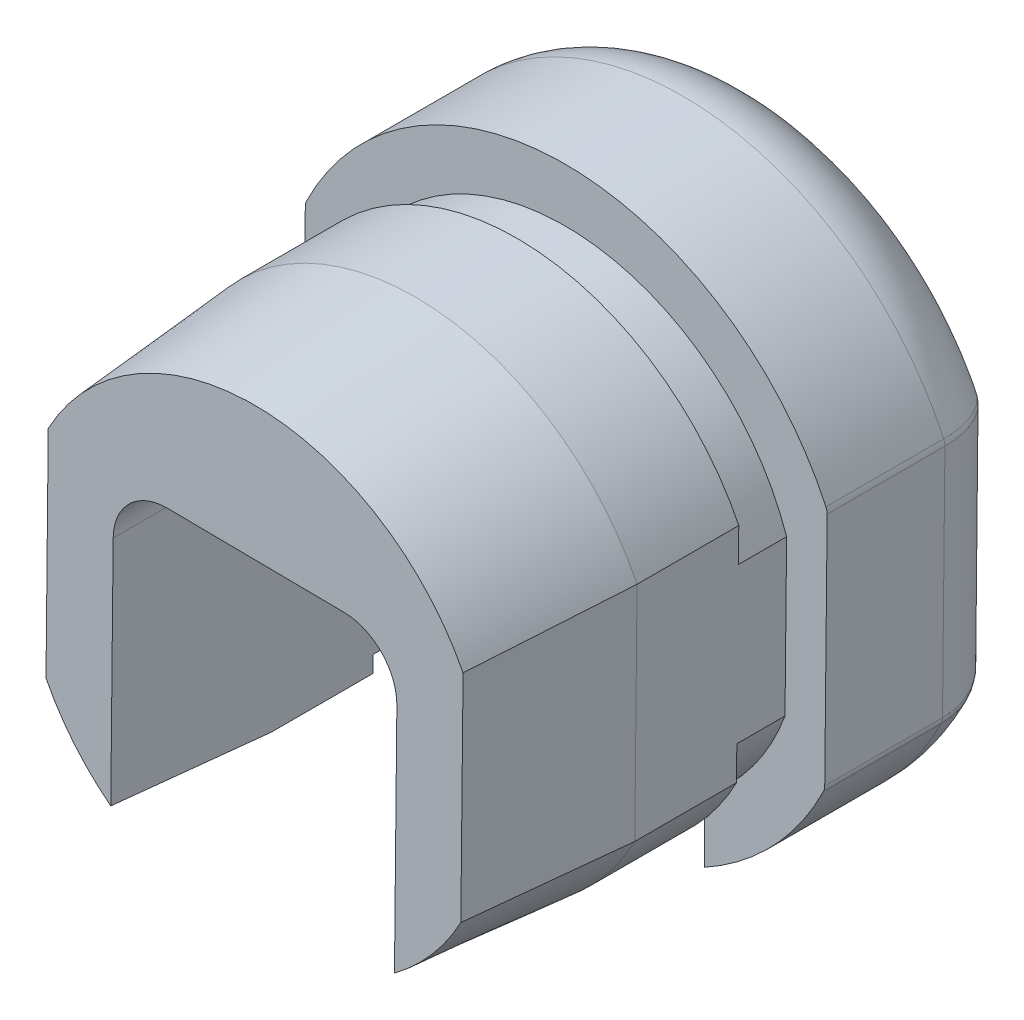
ISO-10303-21;
HEADER;
FILE_DESCRIPTION(('STEP AP214'),'2;1');
FILE_NAME('part.step','',(''),(''),'','','');
FILE_SCHEMA(('AUTOMOTIVE_DESIGN { 1 0 10303 214 1 1 1 1 }'));
ENDSEC;
DATA;
#1=APPLICATION_CONTEXT('core data for automotive mechanical design processes');
#2=APPLICATION_PROTOCOL_DEFINITION('international standard','automotive_design',2000,#1);
#3=PRODUCT_CONTEXT('',#1,'mechanical');
#4=PRODUCT('Part','Part','',(#3));
#5=PRODUCT_RELATED_PRODUCT_CATEGORY('part','',(#4));
#6=PRODUCT_DEFINITION_FORMATION('','',#4);
#7=PRODUCT_DEFINITION_CONTEXT('part definition',#1,'design');
#8=PRODUCT_DEFINITION('design','',#6,#7);
#9=PRODUCT_DEFINITION_SHAPE('','',#8);
#10=(LENGTH_UNIT() NAMED_UNIT(*) SI_UNIT(.MILLI.,.METRE.));
#11=(NAMED_UNIT(*) PLANE_ANGLE_UNIT() SI_UNIT($,.RADIAN.));
#12=(NAMED_UNIT(*) SI_UNIT($,.STERADIAN.) SOLID_ANGLE_UNIT());
#13=UNCERTAINTY_MEASURE_WITH_UNIT(LENGTH_MEASURE(1.E-05),#10,'distance_accuracy_value','');
#14=(GEOMETRIC_REPRESENTATION_CONTEXT(3) GLOBAL_UNCERTAINTY_ASSIGNED_CONTEXT((#13)) GLOBAL_UNIT_ASSIGNED_CONTEXT((#10,
#11,#12)) REPRESENTATION_CONTEXT('',''));
#15=CARTESIAN_POINT('',(0.,0.,0.));
#16=DIRECTION('',(0.,0.,1.));
#17=DIRECTION('',(1.,0.,0.));
#18=AXIS2_PLACEMENT_3D('',#15,#16,#17);
#19=CARTESIAN_POINT('',(-202.01033408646,30.2273594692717,-381.4));
#20=CARTESIAN_POINT('',(-202.01033408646,30.2273594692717,-381.4));
#21=CARTESIAN_POINT('',(-202.01033408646,30.2273594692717,-381.4));
#22=CARTESIAN_POINT('',(-202.204039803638,30.2718306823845,-381.4));
#23=CARTESIAN_POINT('',(-202.201868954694,30.2797577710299,-381.400000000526));
#24=CARTESIAN_POINT('',(-202.199702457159,30.2876862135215,-381.4));
#25=CARTESIAN_POINT('',(-202.395439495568,30.315100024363,-381.381274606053));
#26=CARTESIAN_POINT('',(-202.391398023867,30.330667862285,-381.381658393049));
#27=CARTESIAN_POINT('',(-202.387078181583,30.3461611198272,-381.381274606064));
#28=CARTESIAN_POINT('',(-202.772108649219,30.3990087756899,-381.307584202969));
#29=CARTESIAN_POINT('',(-202.764704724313,30.4292625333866,-381.309342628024));
#30=CARTESIAN_POINT('',(-202.756244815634,30.4592374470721,-381.307584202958));
#31=CARTESIAN_POINT('',(-202.959172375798,30.4400580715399,-381.251949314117));
#32=CARTESIAN_POINT('',(-202.950489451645,30.4774818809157,-381.254618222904));
#33=CARTESIAN_POINT('',(-202.939795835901,30.5143812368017,-381.251949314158));
#34=CARTESIAN_POINT('',(-203.3193892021,30.5180988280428,-381.104935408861));
#35=CARTESIAN_POINT('',(-203.308844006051,30.5691297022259,-381.10972642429));
#36=CARTESIAN_POINT('',(-203.293567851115,30.6189475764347,-381.104935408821));
#37=CARTESIAN_POINT('',(-203.490569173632,30.5546755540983,-381.014757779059));
#38=CARTESIAN_POINT('',(-203.479557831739,30.6120976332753,-381.020605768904));
#39=CARTESIAN_POINT('',(-203.461846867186,30.6678179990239,-381.014757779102));
#40=CARTESIAN_POINT('',(-203.81510189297,30.6232951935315,-380.80129677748));
#41=CARTESIAN_POINT('',(-203.803926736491,30.6927619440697,-380.809153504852));
#42=CARTESIAN_POINT('',(-203.781094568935,30.7593119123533,-380.801296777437));
#43=CARTESIAN_POINT('',(-203.969913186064,30.655635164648,-380.676317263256));
#44=CARTESIAN_POINT('',(-203.95905098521,30.7308052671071,-380.685001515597));
#45=CARTESIAN_POINT('',(-203.933501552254,30.8023284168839,-380.676317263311));
#46=CARTESIAN_POINT('',(-204.249115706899,30.7134655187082,-380.40110106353));
#47=CARTESIAN_POINT('',(-204.239519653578,30.7989211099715,-380.410912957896));
#48=CARTESIAN_POINT('',(-204.208506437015,30.8791242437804,-380.401101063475));
#49=CARTESIAN_POINT('',(-204.374497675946,30.7391719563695,-380.250763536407));
#50=CARTESIAN_POINT('',(-204.365755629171,30.8292225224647,-380.260812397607));
#51=CARTESIAN_POINT('',(-204.33207724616,30.9131932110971,-380.250763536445));
#52=CARTESIAN_POINT('',(-204.596227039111,30.7843553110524,-379.924175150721));
#53=CARTESIAN_POINT('',(-204.589544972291,30.882567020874,-379.933944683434));
#54=CARTESIAN_POINT('',(-204.550677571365,30.9730058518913,-379.924175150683));
#55=CARTESIAN_POINT('',(-204.692219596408,30.8037568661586,-379.747347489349));
#56=CARTESIAN_POINT('',(-204.686600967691,30.9054861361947,-379.756610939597));
#57=CARTESIAN_POINT('',(-204.645358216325,30.9986488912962,-379.747347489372));
#58=CARTESIAN_POINT('',(-204.921985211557,30.8500226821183,-379.201165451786));
#59=CARTESIAN_POINT('',(-204.919660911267,30.9602872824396,-379.207137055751));
#60=CARTESIAN_POINT('',(-204.872028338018,31.0597556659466,-379.201165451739));
#61=CARTESIAN_POINT('',(-205.003898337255,30.8662879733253,-378.802706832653));
#62=CARTESIAN_POINT('',(-205.002729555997,30.9795096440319,-378.806189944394));
#63=CARTESIAN_POINT('',(-204.952896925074,31.0811817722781,-378.802706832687));
#64=CARTESIAN_POINT('',(-205.003898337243,30.8662879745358,-378.4));
#65=CARTESIAN_POINT('',(-205.002729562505,30.979509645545,-378.4));
#66=CARTESIAN_POINT('',(-204.952896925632,31.0811817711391,-378.4));
#67=(BOUNDED_SURFACE() B_SPLINE_SURFACE(3,2,((#19,#20,#21),(#22,#23,#24),(#25,#26,#27),(#28,#29,
#30),(#31,#32,#33),(#34,#35,#36),(#37,#38,#39),(#40,#41,#42),(#43,#44,#45),(#46,#47,#48),(#49,
#50,#51),(#52,#53,#54),(#55,#56,#57),(#58,#59,#60),(#61,#62,#63),(#64,#65,#66)),.UNSPECIFIED.,
.F.,.F.,.F.) B_SPLINE_SURFACE_WITH_KNOTS((4,2,2,2,2,2,2,4),(3,3),(-1.42662687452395E-05,
0.000481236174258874,0.000976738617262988,0.0014722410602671,0.00196774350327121,
0.00246324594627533,0.00295874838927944,0.00394975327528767),(0.,1.),
.UNSPECIFIED.) GEOMETRIC_REPRESENTATION_ITEM() RATIONAL_B_SPLINE_SURFACE(((1.,1.,1.),(1.,
0.999999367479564,1.),(1.,0.999596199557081,1.),(1.,0.998172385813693,1.),(1.,0.997140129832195,
1.),(1.,0.994661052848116,1.),(1.,0.99323407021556,1.),(1.,0.990193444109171,1.),(1.,
0.988560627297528,1.),(1.,0.985395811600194,1.),(1.,0.983857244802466,1.),(1.,0.981016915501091,
1.),(1.,0.979718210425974,1.),(1.,0.976536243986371,1.),(1.,0.975289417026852,1.),(1.,
0.975304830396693,1.))) REPRESENTATION_ITEM('') SURFACE());
#68=CARTESIAN_POINT('',(-202.01033408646,30.2273594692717,-381.4));
#69=CARTESIAN_POINT('',(-202.059512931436,30.2430267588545,-381.400001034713));
#70=CARTESIAN_POINT('',(-202.108712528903,30.2586291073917,-381.398728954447));
#71=CARTESIAN_POINT('',(-202.206771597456,30.2895808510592,-381.393656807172));
#72=CARTESIAN_POINT('',(-202.255631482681,30.3049311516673,-381.389870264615));
#73=CARTESIAN_POINT('',(-202.352892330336,30.3353410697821,-381.379814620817));
#74=CARTESIAN_POINT('',(-202.401294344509,30.3504018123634,-381.373559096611));
#75=CARTESIAN_POINT('',(-202.497523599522,30.3801990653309,-381.358618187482));
#76=CARTESIAN_POINT('',(-202.545352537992,30.3949369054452,-381.349946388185));
#77=CARTESIAN_POINT('',(-202.640323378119,30.4240580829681,-381.330230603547));
#78=CARTESIAN_POINT('',(-202.687467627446,30.4384429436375,-381.31920017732));
#79=CARTESIAN_POINT('',(-202.780960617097,30.4668312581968,-381.294829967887));
#80=CARTESIAN_POINT('',(-202.827312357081,30.4808364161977,-381.281503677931));
#81=CARTESIAN_POINT('',(-202.919115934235,30.508441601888,-381.252609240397));
#82=CARTESIAN_POINT('',(-202.964571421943,30.5220435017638,-381.237054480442));
#83=CARTESIAN_POINT('',(-203.054482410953,30.5488215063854,-381.203774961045));
#84=CARTESIAN_POINT('',(-203.098942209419,30.5619996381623,-381.186063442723));
#85=CARTESIAN_POINT('',(-203.186766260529,30.5879123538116,-381.148546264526));
#86=CARTESIAN_POINT('',(-203.230135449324,30.6006491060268,-381.128753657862));
#87=CARTESIAN_POINT('',(-203.315687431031,30.6256640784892,-381.087153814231));
#88=CARTESIAN_POINT('',(-203.35787578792,30.6379445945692,-381.065359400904));
#89=CARTESIAN_POINT('',(-203.440980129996,30.6620347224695,-381.019838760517));
#90=CARTESIAN_POINT('',(-203.481902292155,30.6738467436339,-380.996125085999));
#91=CARTESIAN_POINT('',(-203.562393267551,30.6969899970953,-380.946851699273));
#92=CARTESIAN_POINT('',(-203.601968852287,30.7083237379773,-380.921304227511));
#93=CARTESIAN_POINT('',(-203.679690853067,30.7305027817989,-380.868451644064));
#94=CARTESIAN_POINT('',(-203.717844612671,30.7413506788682,-380.841158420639));
#95=CARTESIAN_POINT('',(-203.792652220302,30.7625528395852,-380.784905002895));
#96=CARTESIAN_POINT('',(-203.829313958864,30.7729097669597,-380.755956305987));
#97=CARTESIAN_POINT('',(-203.90107255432,30.7931257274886,-380.696484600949));
#98=CARTESIAN_POINT('',(-203.936177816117,30.8029874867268,-380.665972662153));
#99=CARTESIAN_POINT('',(-204.004761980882,30.8222146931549,-380.603468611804));
#100=CARTESIAN_POINT('',(-204.03824978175,30.831582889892,-380.571487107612));
#101=CARTESIAN_POINT('',(-204.105630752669,30.8503924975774,-380.504057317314));
#102=CARTESIAN_POINT('',(-204.139437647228,30.8598074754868,-380.468515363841));
#103=CARTESIAN_POINT('',(-204.205305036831,30.8780997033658,-380.395758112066));
#104=CARTESIAN_POINT('',(-204.237366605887,30.8869772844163,-380.358543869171));
#105=CARTESIAN_POINT('',(-204.299660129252,30.9041835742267,-380.282530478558));
#106=CARTESIAN_POINT('',(-204.329893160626,30.9125126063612,-380.243732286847));
#107=CARTESIAN_POINT('',(-204.388452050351,30.9286074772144,-380.164644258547));
#108=CARTESIAN_POINT('',(-204.416778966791,30.9363736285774,-380.124355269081));
#109=CARTESIAN_POINT('',(-204.471452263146,30.9513306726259,-380.04238257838));
#110=CARTESIAN_POINT('',(-204.497799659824,30.9585218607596,-380.000699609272));
#111=CARTESIAN_POINT('',(-204.548445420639,30.9723176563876,-379.916039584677));
#112=CARTESIAN_POINT('',(-204.572744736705,30.9789225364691,-379.87306314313));
#113=CARTESIAN_POINT('',(-204.619230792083,30.991535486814,-379.785920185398));
#114=CARTESIAN_POINT('',(-204.641418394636,30.99754380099,-379.741754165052));
#115=CARTESIAN_POINT('',(-204.683622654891,31.0089543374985,-379.652339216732));
#116=CARTESIAN_POINT('',(-204.703640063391,31.014356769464,-379.607090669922));
#117=CARTESIAN_POINT('',(-204.741450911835,31.0245471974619,-379.515620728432));
#118=CARTESIAN_POINT('',(-204.759244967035,31.0293353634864,-379.469399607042));
#119=CARTESIAN_POINT('',(-204.792561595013,31.0382898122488,-379.376097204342));
#120=CARTESIAN_POINT('',(-204.808084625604,31.0424562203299,-379.329016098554));
#121=CARTESIAN_POINT('',(-204.836817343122,31.0501605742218,-379.234108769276));
#122=CARTESIAN_POINT('',(-204.850027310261,31.0536985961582,-379.186282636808));
#123=CARTESIAN_POINT('',(-204.874097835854,31.0601404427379,-379.090002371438));
#124=CARTESIAN_POINT('',(-204.884958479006,31.0630442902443,-379.041548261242));
#125=CARTESIAN_POINT('',(-204.904300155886,31.0682128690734,-378.944130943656));
#126=CARTESIAN_POINT('',(-204.912781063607,31.070477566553,-378.895167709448));
#127=CARTESIAN_POINT('',(-204.92733920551,31.0743637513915,-378.796852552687));
#128=CARTESIAN_POINT('',(-204.933416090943,31.0759851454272,-378.747500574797));
#129=CARTESIAN_POINT('',(-204.943147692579,31.0785813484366,-378.648529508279));
#130=CARTESIAN_POINT('',(-204.946801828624,31.0795560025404,-378.598910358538));
#131=CARTESIAN_POINT('',(-204.951677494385,31.0808564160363,-378.49952754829));
#132=CARTESIAN_POINT('',(-204.952898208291,31.0811819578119,-378.449763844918));
#133=CARTESIAN_POINT('',(-204.952896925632,31.0811817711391,-378.4));
#134=B_SPLINE_CURVE_WITH_KNOTS('',3,(#68,#69,#70,#71,#72,#73,#74,#75,#76,#77,#78,#79,#80,#81,
#82,#83,#84,#85,#86,#87,#88,#89,#90,#91,#92,#93,#94,#95,#96,#97,#98,#99,#100,#101,#102,#103,
#104,#105,#106,#107,#108,#109,#110,#111,#112,#113,#114,#115,#116,#117,#118,#119,#120,#121,#122,
#123,#124,#125,#126,#127,#128,#129,#130,#131,#132,#133),.UNSPECIFIED.,.F.,.F.,(4,2,2,2,2,2,2,2,
2,2,2,2,2,2,2,2,2,2,2,2,2,2,2,2,2,2,2,2,2,2,2,2,4),(0.,0.154826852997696,0.308827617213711,
0.461993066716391,0.614314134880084,0.765782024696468,0.916388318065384,1.06612508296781,
1.21498497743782,1.36296134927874,1.51004833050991,1.65624092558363,1.80153509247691,
1.94592781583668,2.0894171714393,2.23200238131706,2.37368385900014,2.5234652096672,
2.67315332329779,2.82275238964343,2.97226771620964,3.12170571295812,3.27107386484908,
3.42038069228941,3.5696356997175,3.71884931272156,3.86803280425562,4.01719821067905,
4.16635823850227,4.31552616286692,4.46471571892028,4.61394098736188,4.76321627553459),.UNSPECIFIED.);
#135=CARTESIAN_POINT('',(-202.01033408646,30.2273594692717,-381.4));
#136=VERTEX_POINT('',#135);
#137=CARTESIAN_POINT('',(-204.952896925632,31.0811817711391,-378.4));
#138=VERTEX_POINT('',#137);
#139=EDGE_CURVE('E787',#136,#138,#134,.T.);
#140=CARTESIAN_POINT('',(-202.01033408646,30.2273594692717,-381.4));
#141=CARTESIAN_POINT('',(-202.06549867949,30.2400249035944,-381.400004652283));
#142=CARTESIAN_POINT('',(-202.120676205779,30.2526383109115,-381.398481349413));
#143=CARTESIAN_POINT('',(-202.230618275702,30.2776628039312,-381.392390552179));
#144=CARTESIAN_POINT('',(-202.285383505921,30.2900745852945,-381.387838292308));
#145=CARTESIAN_POINT('',(-202.394464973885,30.3146906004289,-381.375718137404));
#146=CARTESIAN_POINT('',(-202.448782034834,30.3268953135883,-381.368158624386));
#147=CARTESIAN_POINT('',(-202.556966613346,30.3510992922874,-381.350059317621));
#148=CARTESIAN_POINT('',(-202.610834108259,30.3630985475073,-381.339519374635));
#149=CARTESIAN_POINT('',(-202.718188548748,30.3869142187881,-381.315409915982));
#150=CARTESIAN_POINT('',(-202.771672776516,30.3987295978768,-381.301827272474));
#151=CARTESIAN_POINT('',(-202.878040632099,30.4221355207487,-381.271675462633));
#152=CARTESIAN_POINT('',(-202.930921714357,30.4337251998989,-381.255096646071));
#153=CARTESIAN_POINT('',(-203.035814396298,30.4566258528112,-381.218978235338));
#154=CARTESIAN_POINT('',(-203.087824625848,30.4679363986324,-381.199434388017));
#155=CARTESIAN_POINT('',(-203.19058884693,30.490201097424,-381.15751070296));
#156=CARTESIAN_POINT('',(-203.2413459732,30.5011561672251,-381.135139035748));
#157=CARTESIAN_POINT('',(-203.341399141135,30.5226744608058,-381.087669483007));
#158=CARTESIAN_POINT('',(-203.390700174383,30.5332390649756,-381.062582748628));
#159=CARTESIAN_POINT('',(-203.487840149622,30.5539842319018,-381.009687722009));
#160=CARTESIAN_POINT('',(-203.535680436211,30.5641651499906,-380.981882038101));
#161=CARTESIAN_POINT('',(-203.629937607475,30.5841596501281,-380.923551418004));
#162=CARTESIAN_POINT('',(-203.676350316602,30.5939721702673,-380.893019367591));
#163=CARTESIAN_POINT('',(-203.767740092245,30.6132339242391,-380.829145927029));
#164=CARTESIAN_POINT('',(-203.812705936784,30.6226803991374,-380.795787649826));
#165=CARTESIAN_POINT('',(-203.900892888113,30.6411535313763,-380.726505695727));
#166=CARTESIAN_POINT('',(-203.944109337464,30.65017907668,-380.690575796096));
#167=CARTESIAN_POINT('',(-204.028414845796,30.6677374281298,-380.616382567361));
#168=CARTESIAN_POINT('',(-204.069508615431,30.6762713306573,-380.578124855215));
#169=CARTESIAN_POINT('',(-204.149334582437,30.6928058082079,-380.499476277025));
#170=CARTESIAN_POINT('',(-204.188076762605,30.7008086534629,-380.459096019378));
#171=CARTESIAN_POINT('',(-204.263226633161,30.7162951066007,-380.376247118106));
#172=CARTESIAN_POINT('',(-204.299638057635,30.7237795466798,-380.333782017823));
#173=CARTESIAN_POINT('',(-204.370106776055,30.7382321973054,-380.246748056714));
#174=CARTESIAN_POINT('',(-204.404160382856,30.7451996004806,-380.202176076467));
#175=CARTESIAN_POINT('',(-204.469913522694,30.7586257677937,-380.110932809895));
#176=CARTESIAN_POINT('',(-204.501601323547,30.7650820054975,-380.064252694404));
#177=CARTESIAN_POINT('',(-204.562441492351,30.7774550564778,-379.968893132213));
#178=CARTESIAN_POINT('',(-204.591581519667,30.7833692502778,-379.920205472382));
#179=CARTESIAN_POINT('',(-204.647129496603,30.7946243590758,-379.821210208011));
#180=CARTESIAN_POINT('',(-204.673536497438,30.7999650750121,-379.7709020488));
#181=CARTESIAN_POINT('',(-204.723387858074,30.8100319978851,-379.669038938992));
#182=CARTESIAN_POINT('',(-204.746844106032,30.8147606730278,-379.617490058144));
#183=CARTESIAN_POINT('',(-204.790715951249,30.8235950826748,-379.51321693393));
#184=CARTESIAN_POINT('',(-204.81113912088,30.8277023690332,-379.460496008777));
#185=CARTESIAN_POINT('',(-204.8490232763,30.8353141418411,-379.353832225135));
#186=CARTESIAN_POINT('',(-204.866477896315,30.8388173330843,-379.299887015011));
#187=CARTESIAN_POINT('',(-204.898360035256,30.8452100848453,-379.190947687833));
#188=CARTESIAN_POINT('',(-204.912780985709,30.848098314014,-379.135951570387));
#189=CARTESIAN_POINT('',(-204.93853475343,30.8532516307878,-379.025085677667));
#190=CARTESIAN_POINT('',(-204.949860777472,30.8555153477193,-378.96921426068));
#191=CARTESIAN_POINT('',(-204.969362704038,30.8594097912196,-378.856772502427));
#192=CARTESIAN_POINT('',(-204.977531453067,30.8610390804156,-378.800200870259));
#193=CARTESIAN_POINT('',(-204.990656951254,30.8636548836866,-378.68653324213));
#194=CARTESIAN_POINT('',(-204.99560594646,30.8646398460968,-378.629436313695));
#195=CARTESIAN_POINT('',(-205.002231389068,30.8659574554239,-378.514893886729));
#196=CARTESIAN_POINT('',(-205.003899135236,30.8662883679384,-378.45744786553));
#197=CARTESIAN_POINT('',(-205.003898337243,30.8662879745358,-378.4));
#198=B_SPLINE_CURVE_WITH_KNOTS('',3,(#140,#141,#142,#143,#144,#145,#146,#147,#148,#149,#150,
#151,#152,#153,#154,#155,#156,#157,#158,#159,#160,#161,#162,#163,#164,#165,#166,#167,#168,#169,
#170,#171,#172,#173,#174,#175,#176,#177,#178,#179,#180,#181,#182,#183,#184,#185,#186,#187,#188,
#189,#190,#191,#192,#193,#194,#195,#196,#197),.UNSPECIFIED.,.F.,.F.,(4,2,2,2,2,2,2,2,2,2,2,2,2,
2,2,2,2,2,2,2,2,2,2,2,2,2,2,2,4),(0.,0.169780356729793,0.338713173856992,0.507178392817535,
0.675652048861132,0.844867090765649,1.01463719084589,1.18465315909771,1.35418866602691,
1.52305254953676,1.69175599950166,1.86091330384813,2.03116426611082,2.20184211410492,
2.37212330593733,2.54162213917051,2.71084224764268,2.88032126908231,3.0505915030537,
3.22164540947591,3.3927585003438,3.56315847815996,3.73312561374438,3.90345275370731,
4.07414497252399,4.24520889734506,4.4166581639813,4.58851880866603,4.76083458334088),.UNSPECIFIED.);
#199=CARTESIAN_POINT('',(-205.003898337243,30.8662879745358,-378.4));
#200=VERTEX_POINT('',#199);
#201=EDGE_CURVE('E736',#200,#136,#198,.F.);
#202=CARTESIAN_POINT('',(-204.503924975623,30.8611268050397,-378.4));
#203=DIRECTION('',(0.,0.,-1.));
#204=DIRECTION('',(0.,1.,0.));
#205=AXIS2_PLACEMENT_3D('',#202,#203,#204);
#206=CIRCLE('',#205,0.500000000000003);
#207=EDGE_CURVE('E597',#138,#200,#206,.F.);
#208=ORIENTED_EDGE('',*,*,#139,.F.);
#209=ORIENTED_EDGE('',*,*,#201,.F.);
#210=ORIENTED_EDGE('',*,*,#207,.F.);
#211=EDGE_LOOP('',(#208,#209,#210));
#212=FACE_BOUND('',#211,.T.);
#213=ADVANCED_FACE('F17',(#212),#67,.T.);
#214=CARTESIAN_POINT('',(-188.511053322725,30.0880078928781,-381.4));
#215=CARTESIAN_POINT('',(-188.511053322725,30.0880078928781,-381.4));
#216=CARTESIAN_POINT('',(-188.511053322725,30.0880078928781,-381.4));
#217=CARTESIAN_POINT('',(-188.320479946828,30.1444125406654,-381.4));
#218=CARTESIAN_POINT('',(-188.318477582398,30.1364410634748,-381.399999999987));
#219=CARTESIAN_POINT('',(-188.316470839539,30.1284708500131,-381.4));
#220=CARTESIAN_POINT('',(-188.131937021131,30.1990068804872,-381.381274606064));
#221=CARTESIAN_POINT('',(-188.127937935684,30.183427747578,-381.38165839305));
#222=CARTESIAN_POINT('',(-188.124218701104,30.1677797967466,-381.381274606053));
#223=CARTESIAN_POINT('',(-187.760514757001,30.3044381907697,-381.307584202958));
#224=CARTESIAN_POINT('',(-187.752675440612,30.2742950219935,-381.309342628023));
#225=CARTESIAN_POINT('',(-187.745897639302,30.2438948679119,-381.307584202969));
#226=CARTESIAN_POINT('',(-187.575864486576,30.3557810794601,-381.251949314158));
#227=CARTESIAN_POINT('',(-187.565934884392,30.3186688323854,-381.254618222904));
#228=CARTESIAN_POINT('',(-187.558026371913,30.2810737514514,-381.251949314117));
#229=CARTESIAN_POINT('',(-187.220009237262,30.4530220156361,-381.104935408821));
#230=CARTESIAN_POINT('',(-187.205764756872,30.4028994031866,-381.10972642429));
#231=CARTESIAN_POINT('',(-187.196275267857,30.3516617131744,-381.104935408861));
#232=CARTESIAN_POINT('',(-187.050757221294,30.4984081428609,-381.014757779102));
#233=CARTESIAN_POINT('',(-187.034200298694,30.4423340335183,-381.020605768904));
#234=CARTESIAN_POINT('',(-187.024376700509,30.3846968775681,-381.014757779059));
#235=CARTESIAN_POINT('',(-186.72968878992,30.5832921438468,-380.801296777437));
#236=CARTESIAN_POINT('',(-186.708235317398,30.516285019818,-380.809153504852));
#237=CARTESIAN_POINT('',(-186.698496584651,30.4466023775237,-380.80129677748));
#238=CARTESIAN_POINT('',(-186.576426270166,30.6231532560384,-380.676317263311));
#239=CARTESIAN_POINT('',(-186.552358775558,30.5511179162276,-380.685001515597));
#240=CARTESIAN_POINT('',(-186.543050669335,30.4757395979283,-380.676317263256));
#241=CARTESIAN_POINT('',(-186.299894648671,30.6942556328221,-380.401101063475));
#242=CARTESIAN_POINT('',(-186.270543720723,30.6134293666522,-380.410912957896));
#243=CARTESIAN_POINT('',(-186.262713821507,30.5277938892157,-380.40110106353));
#244=CARTESIAN_POINT('',(-186.175646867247,30.7257663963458,-380.250763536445));
#245=CARTESIAN_POINT('',(-186.143709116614,30.6411183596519,-380.260812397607));
#246=CARTESIAN_POINT('',(-186.136827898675,30.5509065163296,-380.250763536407));
#247=CARTESIAN_POINT('',(-185.955858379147,30.7810535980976,-379.924175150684));
#248=CARTESIAN_POINT('',(-185.918866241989,30.6898316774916,-379.933944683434));
#249=CARTESIAN_POINT('',(-185.914213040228,30.5915029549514,-379.924175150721));
#250=CARTESIAN_POINT('',(-185.860668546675,30.8047366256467,-379.747347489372));
#251=CARTESIAN_POINT('',(-185.821357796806,30.7107423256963,-379.756610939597));
#252=CARTESIAN_POINT('',(-185.817840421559,30.6089187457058,-379.747347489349));
#253=CARTESIAN_POINT('',(-185.632785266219,30.8611510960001,-379.201165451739));
#254=CARTESIAN_POINT('',(-185.58721622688,30.7607206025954,-379.207137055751));
#255=CARTESIAN_POINT('',(-185.58716867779,30.6504315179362,-379.201165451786));
#256=CARTESIAN_POINT('',(-185.55149160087,30.8809032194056,-378.802706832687));
#257=CARTESIAN_POINT('',(-185.503768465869,30.7782240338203,-378.806189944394));
#258=CARTESIAN_POINT('',(-185.504937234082,30.6650023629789,-378.802706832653));
#259=CARTESIAN_POINT('',(-185.551491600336,30.8809032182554,-378.4));
#260=CARTESIAN_POINT('',(-185.503768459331,30.7782240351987,-378.4));
#261=CARTESIAN_POINT('',(-185.504937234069,30.6650023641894,-378.4));
#262=(BOUNDED_SURFACE() B_SPLINE_SURFACE(3,2,((#214,#215,#216),(#217,#218,#219),(#220,#221,
#222),(#223,#224,#225),(#226,#227,#228),(#229,#230,#231),(#232,#233,#234),(#235,#236,#237),
(#238,#239,#240),(#241,#242,#243),(#244,#245,#246),(#247,#248,#249),(#250,#251,#252),(#253,#254,
#255),(#256,#257,#258),(#259,#260,#261)),.UNSPECIFIED.,.F.,.F.,
.F.) B_SPLINE_SURFACE_WITH_KNOTS((4,2,2,2,2,2,2,4),(3,3),(-1.42662687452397E-05,
0.000481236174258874,0.000976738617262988,0.0014722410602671,0.00196774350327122,
0.00246324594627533,0.00295874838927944,0.00394975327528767),(0.,1.),
.UNSPECIFIED.) GEOMETRIC_REPRESENTATION_ITEM() RATIONAL_B_SPLINE_SURFACE(((1.,1.,1.),(1.,
0.999999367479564,1.),(1.,0.999596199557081,1.),(1.,0.998172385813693,1.),(1.,0.997140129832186,
1.),(1.,0.994661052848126,1.),(1.,0.993234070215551,1.),(1.,0.99019344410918,1.),(1.,
0.988560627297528,1.),(1.,0.985395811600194,1.),(1.,0.983857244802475,1.),(1.,0.981016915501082,
1.),(1.,0.979718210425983,1.),(1.,0.976536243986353,1.),(1.,0.975289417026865,1.),(1.,
0.975304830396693,1.))) REPRESENTATION_ITEM('') SURFACE());
#263=CARTESIAN_POINT('',(-185.504937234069,30.6650023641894,-378.4));
#264=CARTESIAN_POINT('',(-185.504936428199,30.6650027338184,-378.457447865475));
#265=CARTESIAN_POINT('',(-185.506610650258,30.6647063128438,-378.514893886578));
#266=CARTESIAN_POINT('',(-185.513261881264,30.6635257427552,-378.629436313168));
#267=CARTESIAN_POINT('',(-185.518230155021,30.6626431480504,-378.686533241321));
#268=CARTESIAN_POINT('',(-185.531406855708,30.6602988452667,-378.800200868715));
#269=CARTESIAN_POINT('',(-185.5396074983,30.6588385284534,-378.85677250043));
#270=CARTESIAN_POINT('',(-185.559185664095,30.6553474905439,-378.969214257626));
#271=CARTESIAN_POINT('',(-185.570556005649,30.6533180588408,-379.02508567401));
#272=CARTESIAN_POINT('',(-185.596410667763,30.6486974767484,-379.135951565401));
#273=CARTESIAN_POINT('',(-185.610888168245,30.6461075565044,-379.190947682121));
#274=CARTESIAN_POINT('',(-185.642895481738,30.6403743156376,-379.299887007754));
#275=CARTESIAN_POINT('',(-185.660418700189,30.6372321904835,-379.353832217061));
#276=CARTESIAN_POINT('',(-185.698451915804,30.6304040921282,-379.460495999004));
#277=CARTESIAN_POINT('',(-185.718955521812,30.6267192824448,-379.513216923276));
#278=CARTESIAN_POINT('',(-185.763000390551,30.6187924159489,-379.6174900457));
#279=CARTESIAN_POINT('',(-185.786549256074,30.6145489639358,-379.669038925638));
#280=CARTESIAN_POINT('',(-185.836597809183,30.6055132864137,-379.770902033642));
#281=CARTESIAN_POINT('',(-185.86310943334,30.6007188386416,-379.821210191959));
#282=CARTESIAN_POINT('',(-185.918877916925,30.5906128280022,-379.920205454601));
#283=CARTESIAN_POINT('',(-185.948133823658,30.5853014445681,-379.968893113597));
#284=CARTESIAN_POINT('',(-186.009216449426,30.5741869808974,-380.064252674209));
#285=CARTESIAN_POINT('',(-186.04103077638,30.5683862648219,-380.110932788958));
#286=CARTESIAN_POINT('',(-186.107047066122,30.5563203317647,-380.202176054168));
#287=CARTESIAN_POINT('',(-186.141237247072,30.5500573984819,-380.246748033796));
#288=CARTESIAN_POINT('',(-186.211989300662,30.5370625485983,-380.333781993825));
#289=CARTESIAN_POINT('',(-186.248547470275,30.5303313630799,-380.376247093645));
#290=CARTESIAN_POINT('',(-186.32400101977,30.5163995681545,-380.459095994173));
#291=CARTESIAN_POINT('',(-186.362900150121,30.5091982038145,-380.499476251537));
#292=CARTESIAN_POINT('',(-186.44305043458,30.4943151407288,-380.578124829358));
#293=CARTESIAN_POINT('',(-186.484311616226,30.4866313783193,-380.616382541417));
#294=CARTESIAN_POINT('',(-186.568961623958,30.4708171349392,-380.690575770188));
#295=CARTESIAN_POINT('',(-186.612355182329,30.4626856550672,-380.726505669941));
#296=CARTESIAN_POINT('',(-186.700904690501,30.4460369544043,-380.795787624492));
#297=CARTESIAN_POINT('',(-186.7460559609,30.4375207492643,-380.829145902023));
#298=CARTESIAN_POINT('',(-186.837823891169,30.4201497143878,-380.893019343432));
#299=CARTESIAN_POINT('',(-186.8844292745,30.4112974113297,-380.92355139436));
#300=CARTESIAN_POINT('',(-186.979079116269,30.3932529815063,-380.981882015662));
#301=CARTESIAN_POINT('',(-187.027119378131,30.3840618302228,-381.009687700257));
#302=CARTESIAN_POINT('',(-187.124666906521,30.3653264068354,-381.062582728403));
#303=CARTESIAN_POINT('',(-187.174175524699,30.3557818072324,-381.087669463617));
#304=CARTESIAN_POINT('',(-187.274651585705,30.3363335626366,-381.135139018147));
#305=CARTESIAN_POINT('',(-187.325624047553,30.3264286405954,-381.157510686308));
#306=CARTESIAN_POINT('',(-187.428825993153,30.3062901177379,-381.199434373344));
#307=CARTESIAN_POINT('',(-187.481058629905,30.2960556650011,-381.218978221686));
#308=CARTESIAN_POINT('',(-187.586401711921,30.2753252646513,-381.255096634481));
#309=CARTESIAN_POINT('',(-187.639510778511,30.2648297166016,-381.271675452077));
#310=CARTESIAN_POINT('',(-187.746339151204,30.2436246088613,-381.301827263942));
#311=CARTESIAN_POINT('',(-187.800055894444,30.2329158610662,-381.315409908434));
#312=CARTESIAN_POINT('',(-187.907879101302,30.2113214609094,-381.339519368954));
#313=CARTESIAN_POINT('',(-187.961982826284,30.2004367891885,-381.350059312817));
#314=CARTESIAN_POINT('',(-188.070644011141,30.178471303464,-381.368158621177));
#315=CARTESIAN_POINT('',(-188.125201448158,30.1673904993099,-381.375718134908));
#316=CARTESIAN_POINT('',(-188.234767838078,30.1450315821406,-381.387838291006));
#317=CARTESIAN_POINT('',(-188.289777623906,30.1337530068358,-381.392390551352));
#318=CARTESIAN_POINT('',(-188.400212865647,30.1110034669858,-381.398481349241));
#319=CARTESIAN_POINT('',(-188.455639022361,30.0995318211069,-381.400004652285));
#320=CARTESIAN_POINT('',(-188.511053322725,30.0880078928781,-381.4));
#321=B_SPLINE_CURVE_WITH_KNOTS('',3,(#263,#264,#265,#266,#267,#268,#269,#270,#271,#272,#273,
#274,#275,#276,#277,#278,#279,#280,#281,#282,#283,#284,#285,#286,#287,#288,#289,#290,#291,#292,
#293,#294,#295,#296,#297,#298,#299,#300,#301,#302,#303,#304,#305,#306,#307,#308,#309,#310,#311,
#312,#313,#314,#315,#316,#317,#318,#319,#320),.UNSPECIFIED.,.F.,.F.,(4,2,2,2,2,2,2,2,2,2,2,2,2,
2,2,2,2,2,2,2,2,2,2,2,2,2,2,2,4),(0.,0.172315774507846,0.344176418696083,0.515625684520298,
0.686689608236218,0.8573818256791,1.02770896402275,1.19767609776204,1.3680760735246,
1.53918916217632,1.71024306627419,1.88051329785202,2.04999231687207,2.21921242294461,
2.38871125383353,2.55899244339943,2.72967028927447,2.89992124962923,3.06907855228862,
3.23778200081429,3.40664588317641,3.57618138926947,3.7461973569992,3.9159674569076,
4.08518249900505,4.25365615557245,4.422121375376,4.59105419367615,4.76083455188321),.UNSPECIFIED.);
#322=CARTESIAN_POINT('',(-188.511053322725,30.0880078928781,-381.4));
#323=VERTEX_POINT('',#322);
#324=CARTESIAN_POINT('',(-185.504937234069,30.6650023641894,-378.4));
#325=VERTEX_POINT('',#324);
#326=EDGE_CURVE('E578',#323,#325,#321,.F.);
#327=CARTESIAN_POINT('',(-185.551491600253,30.8809032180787,-378.4));
#328=CARTESIAN_POINT('',(-185.551490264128,30.8809032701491,-378.449760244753));
#329=CARTESIAN_POINT('',(-185.552717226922,30.8806029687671,-378.499520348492));
#330=CARTESIAN_POINT('',(-185.557617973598,30.8794035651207,-378.59889646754));
#331=CARTESIAN_POINT('',(-185.56129096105,30.8785046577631,-378.648512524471));
#332=CARTESIAN_POINT('',(-185.571072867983,30.8761102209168,-378.747477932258));
#333=CARTESIAN_POINT('',(-185.577181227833,30.8746148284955,-378.796827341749));
#334=CARTESIAN_POINT('',(-185.591814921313,30.8710304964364,-378.895137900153));
#335=CARTESIAN_POINT('',(-185.600339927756,30.8689416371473,-378.944099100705));
#336=CARTESIAN_POINT('',(-185.619782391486,30.8641740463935,-379.041512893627));
#337=CARTESIAN_POINT('',(-185.630699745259,30.8614953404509,-379.089965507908));
#338=CARTESIAN_POINT('',(-185.654896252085,30.8555524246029,-379.186243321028));
#339=CARTESIAN_POINT('',(-185.668175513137,30.852288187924,-379.234068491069));
#340=CARTESIAN_POINT('',(-185.697059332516,30.845179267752,-379.32897442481));
#341=CARTESIAN_POINT('',(-185.712664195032,30.8413345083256,-379.376055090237));
#342=CARTESIAN_POINT('',(-185.746156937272,30.8330703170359,-379.469357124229));
#343=CARTESIAN_POINT('',(-185.764045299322,30.8286507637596,-379.515578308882));
#344=CARTESIAN_POINT('',(-185.802057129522,30.8192435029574,-379.607048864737));
#345=CARTESIAN_POINT('',(-185.822181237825,30.8142556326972,-379.652297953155));
#346=CARTESIAN_POINT('',(-185.864611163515,30.8037190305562,-379.741714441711));
#347=CARTESIAN_POINT('',(-185.886917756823,30.7981700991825,-379.785881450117));
#348=CARTESIAN_POINT('',(-185.933653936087,30.7865194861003,-379.873026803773));
#349=CARTESIAN_POINT('',(-185.958084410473,30.7804175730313,-379.916004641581));
#350=CARTESIAN_POINT('',(-186.009004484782,30.7676699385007,-380.000667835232));
#351=CARTESIAN_POINT('',(-186.035495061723,30.7610239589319,-380.042352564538));
#352=CARTESIAN_POINT('',(-186.090466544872,30.7471981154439,-380.12432910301));
#353=CARTESIAN_POINT('',(-186.118948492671,30.7400179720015,-380.164620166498));
#354=CARTESIAN_POINT('',(-186.177829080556,30.7251343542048,-380.243712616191));
#355=CARTESIAN_POINT('',(-186.208228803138,30.7174305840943,-380.282513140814));
#356=CARTESIAN_POINT('',(-186.270867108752,30.7015124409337,-380.358531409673));
#357=CARTESIAN_POINT('',(-186.303106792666,30.6932977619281,-380.395748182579));
#358=CARTESIAN_POINT('',(-186.369341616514,30.6763671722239,-380.468510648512));
#359=CARTESIAN_POINT('',(-186.403337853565,30.6676509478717,-380.504055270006));
#360=CARTESIAN_POINT('',(-186.471092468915,30.6502352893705,-380.571485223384));
#361=CARTESIAN_POINT('',(-186.504763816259,30.6415605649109,-380.60346446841));
#362=CARTESIAN_POINT('',(-186.573725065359,30.623753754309,-380.665964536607));
#363=CARTESIAN_POINT('',(-186.609023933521,30.614619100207,-380.6964747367));
#364=CARTESIAN_POINT('',(-186.681179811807,30.5958894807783,-380.755943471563));
#365=CARTESIAN_POINT('',(-186.71804529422,30.5862919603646,-380.784890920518));
#366=CARTESIAN_POINT('',(-186.793270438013,30.5666394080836,-380.841142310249));
#367=CARTESIAN_POINT('',(-186.831638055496,30.5565818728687,-380.868434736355));
#368=CARTESIAN_POINT('',(-186.909797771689,30.5360128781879,-380.921286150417));
#369=CARTESIAN_POINT('',(-186.949597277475,30.5254989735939,-380.946833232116));
#370=CARTESIAN_POINT('',(-187.030545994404,30.5040231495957,-380.996106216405));
#371=CARTESIAN_POINT('',(-187.071702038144,30.4930588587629,-381.019819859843));
#372=CARTESIAN_POINT('',(-187.155283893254,30.4706902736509,-381.06534076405));
#373=CARTESIAN_POINT('',(-187.197715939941,30.4592836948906,-381.0871354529));
#374=CARTESIAN_POINT('',(-187.28376484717,30.4360409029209,-381.128736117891));
#375=CARTESIAN_POINT('',(-187.327387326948,30.4242025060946,-381.148529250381));
#376=CARTESIAN_POINT('',(-187.415727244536,30.4001089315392,-381.186047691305));
#377=CARTESIAN_POINT('',(-187.460449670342,30.3878516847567,-381.203759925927));
#378=CARTESIAN_POINT('',(-187.550894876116,30.3629359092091,-381.237041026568));
#379=CARTESIAN_POINT('',(-187.596622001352,30.3502754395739,-381.252596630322));
#380=CARTESIAN_POINT('',(-187.688977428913,30.3245715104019,-381.281492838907));
#381=CARTESIAN_POINT('',(-187.735609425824,30.3115262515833,-381.294820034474));
#382=CARTESIAN_POINT('',(-187.829671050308,30.2850739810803,-381.319192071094));
#383=CARTESIAN_POINT('',(-187.877103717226,30.2716653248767,-381.33022339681));
#384=CARTESIAN_POINT('',(-187.972658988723,30.2445105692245,-381.349940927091));
#385=CARTESIAN_POINT('',(-188.020783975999,30.2307629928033,-381.358613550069));
#386=CARTESIAN_POINT('',(-188.117612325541,30.2029579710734,-381.373555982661));
#387=CARTESIAN_POINT('',(-188.166317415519,30.188899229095,-381.379812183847));
#388=CARTESIAN_POINT('',(-188.264190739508,30.1605026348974,-381.389868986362));
#389=CARTESIAN_POINT('',(-188.313360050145,30.1461636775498,-381.393655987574));
#390=CARTESIAN_POINT('',(-188.412043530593,30.1172415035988,-381.39872878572));
#391=CARTESIAN_POINT('',(-188.461558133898,30.1026573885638,-381.40000103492));
#392=CARTESIAN_POINT('',(-188.511053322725,30.0880078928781,-381.4));
#393=B_SPLINE_CURVE_WITH_KNOTS('',3,(#327,#328,#329,#330,#331,#332,#333,#334,#335,#336,#337,
#338,#339,#340,#341,#342,#343,#344,#345,#346,#347,#348,#349,#350,#351,#352,#353,#354,#355,#356,
#357,#358,#359,#360,#361,#362,#363,#364,#365,#366,#367,#368,#369,#370,#371,#372,#373,#374,#375,
#376,#377,#378,#379,#380,#381,#382,#383,#384,#385,#386,#387,#388,#389,#390,#391,#392),
.UNSPECIFIED.,.F.,.F.,(4,2,2,2,2,2,2,2,2,2,2,2,2,2,2,2,2,2,2,2,2,2,2,2,2,2,2,2,2,2,2,2,4),(0.,
0.149264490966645,0.298480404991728,0.44766205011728,0.596823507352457,0.745978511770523,
0.895140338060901,1.04432169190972,1.1935346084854,1.34279035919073,1.49209936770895,
1.64147113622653,1.79091418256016,1.94043598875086,2.09004296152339,2.2397404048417,
2.38953250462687,2.53120351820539,2.673779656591,2.81726133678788,2.96164778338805,
3.10693707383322,3.25312619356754,3.40021110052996,3.54818679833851,3.69704741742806,
3.84678630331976,3.99739611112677,4.14886890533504,4.30119626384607,4.45436938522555,
4.608379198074,4.76321647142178),.UNSPECIFIED.);
#394=CARTESIAN_POINT('',(-185.551491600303,30.8809032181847,-378.4));
#395=VERTEX_POINT('',#394);
#396=EDGE_CURVE('E713',#395,#323,#393,.T.);
#397=CARTESIAN_POINT('',(-186.004910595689,30.6701635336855,-378.4));
#398=DIRECTION('',(0.,0.,-1.));
#399=DIRECTION('',(0.,1.,0.));
#400=AXIS2_PLACEMENT_3D('',#397,#398,#399);
#401=CIRCLE('',#400,0.500000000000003);
#402=EDGE_CURVE('E767',#325,#395,#401,.F.);
#403=ORIENTED_EDGE('',*,*,#326,.F.);
#404=ORIENTED_EDGE('',*,*,#396,.F.);
#405=ORIENTED_EDGE('',*,*,#402,.F.);
#406=EDGE_LOOP('',(#403,#404,#405));
#407=FACE_BOUND('',#406,.T.);
#408=ADVANCED_FACE('F534',(#407),#262,.T.);
#409=CARTESIAN_POINT('',(-188.589665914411,22.4726405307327,-381.4));
#410=CARTESIAN_POINT('',(-188.589665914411,22.4726405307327,-381.4));
#411=CARTESIAN_POINT('',(-188.589665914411,22.4726405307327,-381.4));
#412=CARTESIAN_POINT('',(-188.395960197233,22.42816931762,-381.4));
#413=CARTESIAN_POINT('',(-188.398131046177,22.4202422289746,-381.400000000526));
#414=CARTESIAN_POINT('',(-188.400297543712,22.412313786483,-381.4));
#415=CARTESIAN_POINT('',(-188.204560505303,22.3848999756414,-381.381274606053));
#416=CARTESIAN_POINT('',(-188.208601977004,22.3693321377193,-381.38165839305));
#417=CARTESIAN_POINT('',(-188.212921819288,22.3538388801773,-381.381274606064));
#418=CARTESIAN_POINT('',(-187.827891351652,22.3009912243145,-381.307584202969));
#419=CARTESIAN_POINT('',(-187.835295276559,22.270737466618,-381.309342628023));
#420=CARTESIAN_POINT('',(-187.843755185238,22.2407625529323,-381.307584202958));
#421=CARTESIAN_POINT('',(-187.640827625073,22.2599419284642,-381.251949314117));
#422=CARTESIAN_POINT('',(-187.649510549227,22.2225181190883,-381.254618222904));
#423=CARTESIAN_POINT('',(-187.66020416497,22.1856187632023,-381.251949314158));
#424=CARTESIAN_POINT('',(-187.280610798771,22.1819011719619,-381.104935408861));
#425=CARTESIAN_POINT('',(-187.29115599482,22.130870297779,-381.10972642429));
#426=CARTESIAN_POINT('',(-187.306432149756,22.08105242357,-381.104935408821));
#427=CARTESIAN_POINT('',(-187.109430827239,22.145324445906,-381.014757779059));
#428=CARTESIAN_POINT('',(-187.120442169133,22.0879023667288,-381.020605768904));
#429=CARTESIAN_POINT('',(-187.138153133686,22.0321820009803,-381.014757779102));
#430=CARTESIAN_POINT('',(-186.784898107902,22.0767048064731,-380.80129677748));
#431=CARTESIAN_POINT('',(-186.79607326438,22.007238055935,-380.809153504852));
#432=CARTESIAN_POINT('',(-186.818905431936,21.9406880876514,-380.801296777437));
#433=CARTESIAN_POINT('',(-186.630086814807,22.0443648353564,-380.676317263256));
#434=CARTESIAN_POINT('',(-186.640949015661,21.9691947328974,-380.685001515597));
#435=CARTESIAN_POINT('',(-186.666498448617,21.8976715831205,-380.676317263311));
#436=CARTESIAN_POINT('',(-186.350884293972,21.9865344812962,-380.40110106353));
#437=CARTESIAN_POINT('',(-186.360480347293,21.9010788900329,-380.410912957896));
#438=CARTESIAN_POINT('',(-186.391493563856,21.820875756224,-380.401101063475));
#439=CARTESIAN_POINT('',(-186.225502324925,21.9608280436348,-380.250763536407));
#440=CARTESIAN_POINT('',(-186.2342443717,21.8707774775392,-380.260812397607));
#441=CARTESIAN_POINT('',(-186.267922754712,21.7868067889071,-380.250763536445));
#442=CARTESIAN_POINT('',(-186.00377296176,21.9156446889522,-379.924175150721));
#443=CARTESIAN_POINT('',(-186.01045502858,21.8174329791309,-379.933944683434));
#444=CARTESIAN_POINT('',(-186.049322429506,21.7269941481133,-379.924175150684));
#445=CARTESIAN_POINT('',(-185.907780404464,21.8962431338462,-379.747347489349));
#446=CARTESIAN_POINT('',(-185.91339903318,21.7945138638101,-379.756610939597));
#447=CARTESIAN_POINT('',(-185.954641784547,21.7013511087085,-379.747347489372));
#448=CARTESIAN_POINT('',(-185.678014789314,21.8499773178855,-379.201165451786));
#449=CARTESIAN_POINT('',(-185.680339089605,21.7397127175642,-379.207137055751));
#450=CARTESIAN_POINT('',(-185.727971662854,21.6402443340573,-379.201165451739));
#451=CARTESIAN_POINT('',(-185.596101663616,21.8337120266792,-378.802706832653));
#452=CARTESIAN_POINT('',(-185.597270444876,21.7204903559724,-378.806189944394));
#453=CARTESIAN_POINT('',(-185.647103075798,21.6188182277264,-378.802706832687));
#454=CARTESIAN_POINT('',(-185.596101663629,21.8337120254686,-378.4));
#455=CARTESIAN_POINT('',(-185.597270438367,21.7204903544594,-378.4));
#456=CARTESIAN_POINT('',(-185.64710307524,21.6188182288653,-378.4));
#457=(BOUNDED_SURFACE() B_SPLINE_SURFACE(3,2,((#409,#410,#411),(#412,#413,#414),(#415,#416,
#417),(#418,#419,#420),(#421,#422,#423),(#424,#425,#426),(#427,#428,#429),(#430,#431,#432),
(#433,#434,#435),(#436,#437,#438),(#439,#440,#441),(#442,#443,#444),(#445,#446,#447),(#448,#449,
#450),(#451,#452,#453),(#454,#455,#456)),.UNSPECIFIED.,.F.,.F.,
.F.) B_SPLINE_SURFACE_WITH_KNOTS((4,2,2,2,2,2,2,4),(3,3),(-1.42662687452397E-05,
0.000481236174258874,0.000976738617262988,0.0014722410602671,0.00196774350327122,
0.00246324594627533,0.00295874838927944,0.00394975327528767),(0.,1.),
.UNSPECIFIED.) GEOMETRIC_REPRESENTATION_ITEM() RATIONAL_B_SPLINE_SURFACE(((1.,1.,1.),(1.,
0.999999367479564,1.),(1.,0.999596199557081,1.),(1.,0.998172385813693,1.),(1.,0.997140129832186,
1.),(1.,0.994661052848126,1.),(1.,0.993234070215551,1.),(1.,0.99019344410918,1.),(1.,
0.988560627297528,1.),(1.,0.985395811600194,1.),(1.,0.983857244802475,1.),(1.,0.981016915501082,
1.),(1.,0.979718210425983,1.),(1.,0.976536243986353,1.),(1.,0.975289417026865,1.),(1.,
0.975304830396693,1.))) REPRESENTATION_ITEM('') SURFACE());
#458=CARTESIAN_POINT('',(-188.589665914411,22.4726405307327,-381.4));
#459=CARTESIAN_POINT('',(-188.53450132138,22.4599750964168,-381.400004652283));
#460=CARTESIAN_POINT('',(-188.479323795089,22.4473616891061,-381.398481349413));
#461=CARTESIAN_POINT('',(-188.369381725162,22.4223371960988,-381.392390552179));
#462=CARTESIAN_POINT('',(-188.314616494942,22.4099254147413,-381.387838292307));
#463=CARTESIAN_POINT('',(-188.205535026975,22.385309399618,-381.375718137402));
#464=CARTESIAN_POINT('',(-188.151217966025,22.3731046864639,-381.368158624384));
#465=CARTESIAN_POINT('',(-188.043033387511,22.3489007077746,-381.350059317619));
#466=CARTESIAN_POINT('',(-187.989165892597,22.3369014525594,-381.339519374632));
#467=CARTESIAN_POINT('',(-187.881811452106,22.3130857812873,-381.315409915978));
#468=CARTESIAN_POINT('',(-187.828327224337,22.3012704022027,-381.301827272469));
#469=CARTESIAN_POINT('',(-187.721959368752,22.2778644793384,-381.271675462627));
#470=CARTESIAN_POINT('',(-187.669078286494,22.2662748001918,-381.255096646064));
#471=CARTESIAN_POINT('',(-187.564185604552,22.2433741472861,-381.21897823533));
#472=CARTESIAN_POINT('',(-187.512175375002,22.232063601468,-381.199434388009));
#473=CARTESIAN_POINT('',(-187.409411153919,22.2097989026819,-381.15751070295));
#474=CARTESIAN_POINT('',(-187.358654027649,22.1988438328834,-381.135139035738));
#475=CARTESIAN_POINT('',(-187.258600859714,22.177325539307,-381.087669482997));
#476=CARTESIAN_POINT('',(-187.209299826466,22.1667609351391,-381.062582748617));
#477=CARTESIAN_POINT('',(-187.112159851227,22.1460157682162,-381.009687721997));
#478=CARTESIAN_POINT('',(-187.064319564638,22.1358348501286,-380.981882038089));
#479=CARTESIAN_POINT('',(-186.970062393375,22.1158403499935,-380.923551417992));
#480=CARTESIAN_POINT('',(-186.923649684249,22.1060278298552,-380.893019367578));
#481=CARTESIAN_POINT('',(-186.832259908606,22.0867660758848,-380.829145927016));
#482=CARTESIAN_POINT('',(-186.787294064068,22.0773196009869,-380.795787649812));
#483=CARTESIAN_POINT('',(-186.69910711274,22.0588464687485,-380.726505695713));
#484=CARTESIAN_POINT('',(-186.655890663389,22.0498209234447,-380.690575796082));
#485=CARTESIAN_POINT('',(-186.571585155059,22.0322625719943,-380.616382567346));
#486=CARTESIAN_POINT('',(-186.530491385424,22.0237286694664,-380.578124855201));
#487=CARTESIAN_POINT('',(-186.45066541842,22.0071941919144,-380.499476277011));
#488=CARTESIAN_POINT('',(-186.411923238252,21.9991913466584,-380.459096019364));
#489=CARTESIAN_POINT('',(-186.336773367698,21.9837048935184,-380.376247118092));
#490=CARTESIAN_POINT('',(-186.300361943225,21.9762204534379,-380.33378201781));
#491=CARTESIAN_POINT('',(-186.229893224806,21.9617678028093,-380.246748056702));
#492=CARTESIAN_POINT('',(-186.195839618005,21.9548003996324,-380.202176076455));
#493=CARTESIAN_POINT('',(-186.130086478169,21.9413742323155,-380.110932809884));
#494=CARTESIAN_POINT('',(-186.098398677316,21.9349179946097,-380.064252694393));
#495=CARTESIAN_POINT('',(-186.037558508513,21.9225449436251,-379.968893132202));
#496=CARTESIAN_POINT('',(-186.008418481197,21.9166307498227,-379.920205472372));
#497=CARTESIAN_POINT('',(-185.952870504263,21.9053756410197,-379.821210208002));
#498=CARTESIAN_POINT('',(-185.926463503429,21.9000349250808,-379.770902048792));
#499=CARTESIAN_POINT('',(-185.876612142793,21.889968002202,-379.669038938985));
#500=CARTESIAN_POINT('',(-185.853155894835,21.8852393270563,-379.617490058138));
#501=CARTESIAN_POINT('',(-185.80928404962,21.876404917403,-379.513216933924));
#502=CARTESIAN_POINT('',(-185.788860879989,21.8722976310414,-379.460496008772));
#503=CARTESIAN_POINT('',(-185.75097672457,21.8646858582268,-379.353832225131));
#504=CARTESIAN_POINT('',(-185.733522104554,21.8611826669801,-379.299887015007));
#505=CARTESIAN_POINT('',(-185.701639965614,21.8547899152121,-379.19094768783));
#506=CARTESIAN_POINT('',(-185.687219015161,21.8519016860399,-379.135951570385));
#507=CARTESIAN_POINT('',(-185.661465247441,21.8467483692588,-379.025085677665));
#508=CARTESIAN_POINT('',(-185.650139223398,21.8444846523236,-378.969214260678));
#509=CARTESIAN_POINT('',(-185.630637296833,21.8405902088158,-378.856772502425));
#510=CARTESIAN_POINT('',(-185.622468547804,21.838960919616,-378.800200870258));
#511=CARTESIAN_POINT('',(-185.609343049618,21.8363451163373,-378.686533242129));
#512=CARTESIAN_POINT('',(-185.604394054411,21.8353601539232,-378.629436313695));
#513=CARTESIAN_POINT('',(-185.597768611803,21.8340425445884,-378.514893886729));
#514=CARTESIAN_POINT('',(-185.596100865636,21.83371163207,-378.45744786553));
#515=CARTESIAN_POINT('',(-185.596101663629,21.8337120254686,-378.4));
#516=B_SPLINE_CURVE_WITH_KNOTS('',3,(#458,#459,#460,#461,#462,#463,#464,#465,#466,#467,#468,
#469,#470,#471,#472,#473,#474,#475,#476,#477,#478,#479,#480,#481,#482,#483,#484,#485,#486,#487,
#488,#489,#490,#491,#492,#493,#494,#495,#496,#497,#498,#499,#500,#501,#502,#503,#504,#505,#506,
#507,#508,#509,#510,#511,#512,#513,#514,#515),.UNSPECIFIED.,.F.,.F.,(4,2,2,2,2,2,2,2,2,2,2,2,2,
2,2,2,2,2,2,2,2,2,2,2,2,2,2,2,4),(0.,0.169780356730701,0.338713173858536,0.507178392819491,
0.675652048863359,0.844867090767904,1.0146371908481,1.18465315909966,1.35418866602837,
1.5230525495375,1.69175599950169,1.86091330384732,2.03116426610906,2.20184211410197,
2.37212330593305,2.54162213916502,2.71084224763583,2.88032126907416,3.05059150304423,
3.22164540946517,3.3927585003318,3.56315847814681,3.73312561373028,3.90345275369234,
4.07414497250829,4.24520889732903,4.41665816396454,4.58851880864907,4.76083458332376),.UNSPECIFIED.);
#517=CARTESIAN_POINT('',(-185.596101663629,21.8337120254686,-378.4));
#518=VERTEX_POINT('',#517);
#519=CARTESIAN_POINT('',(-188.589665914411,22.4726405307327,-381.4));
#520=VERTEX_POINT('',#519);
#521=EDGE_CURVE('E565',#518,#520,#516,.F.);
#522=CARTESIAN_POINT('',(-186.096075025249,21.8388731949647,-378.4));
#523=DIRECTION('',(0.,0.,-1.));
#524=DIRECTION('',(0.,1.,0.));
#525=AXIS2_PLACEMENT_3D('',#522,#523,#524);
#526=CIRCLE('',#525,0.500000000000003);
#527=CARTESIAN_POINT('',(-185.647103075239,21.6188182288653,-378.4));
#528=VERTEX_POINT('',#527);
#529=EDGE_CURVE('E568',#528,#518,#526,.F.);
#530=CARTESIAN_POINT('',(-188.589665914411,22.4726405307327,-381.4));
#531=CARTESIAN_POINT('',(-188.54048706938,22.4569732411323,-381.400001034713));
#532=CARTESIAN_POINT('',(-188.491287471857,22.441370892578,-381.398728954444));
#533=CARTESIAN_POINT('',(-188.393228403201,22.4104191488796,-381.393656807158));
#534=CARTESIAN_POINT('',(-188.344368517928,22.3950688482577,-381.389870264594));
#535=CARTESIAN_POINT('',(-188.247107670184,22.3646589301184,-381.379814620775));
#536=CARTESIAN_POINT('',(-188.198705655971,22.3495981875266,-381.373559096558));
#537=CARTESIAN_POINT('',(-188.102476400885,22.319800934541,-381.358618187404));
#538=CARTESIAN_POINT('',(-188.054647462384,22.3050630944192,-381.349946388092));
#539=CARTESIAN_POINT('',(-187.9596766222,22.2759419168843,-381.330230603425));
#540=CARTESIAN_POINT('',(-187.912532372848,22.2615570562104,-381.319200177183));
#541=CARTESIAN_POINT('',(-187.819039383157,22.2331687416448,-381.294829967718));
#542=CARTESIAN_POINT('',(-187.772687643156,22.219163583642,-381.281503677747));
#543=CARTESIAN_POINT('',(-187.680884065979,22.1915583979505,-381.252609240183));
#544=CARTESIAN_POINT('',(-187.635428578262,22.1779564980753,-381.237054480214));
#545=CARTESIAN_POINT('',(-187.545517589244,22.1511784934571,-381.20377496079));
#546=CARTESIAN_POINT('',(-187.501057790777,22.1380003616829,-381.186063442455));
#547=CARTESIAN_POINT('',(-187.413233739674,22.112087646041,-381.148546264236));
#548=CARTESIAN_POINT('',(-187.369864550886,22.0993508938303,-381.128753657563));
#549=CARTESIAN_POINT('',(-187.2843125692,22.0743359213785,-381.087153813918));
#550=CARTESIAN_POINT('',(-187.242124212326,22.0620554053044,-381.065359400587));
#551=CARTESIAN_POINT('',(-187.159019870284,22.0379652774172,-381.019838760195));
#552=CARTESIAN_POINT('',(-187.118097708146,22.0261532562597,-380.996125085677));
#553=CARTESIAN_POINT('',(-187.037606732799,22.0030100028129,-380.946851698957));
#554=CARTESIAN_POINT('',(-186.998031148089,21.9916762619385,-380.921304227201));
#555=CARTESIAN_POINT('',(-186.92030914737,21.9694972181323,-380.868451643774));
#556=CARTESIAN_POINT('',(-186.882155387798,21.9586493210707,-380.841158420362));
#557=CARTESIAN_POINT('',(-186.807347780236,21.937447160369,-380.784905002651));
#558=CARTESIAN_POINT('',(-186.770686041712,21.9270902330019,-380.755956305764));
#559=CARTESIAN_POINT('',(-186.698927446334,21.9068742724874,-380.696484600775));
#560=CARTESIAN_POINT('',(-186.663822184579,21.8970125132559,-380.665972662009));
#561=CARTESIAN_POINT('',(-186.595238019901,21.8777853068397,-380.603468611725));
#562=CARTESIAN_POINT('',(-186.561750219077,21.8684171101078,-380.571487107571));
#563=CARTESIAN_POINT('',(-186.494369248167,21.849607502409,-380.504057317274));
#564=CARTESIAN_POINT('',(-186.460562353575,21.8401925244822,-380.468515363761));
#565=CARTESIAN_POINT('',(-186.394694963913,21.8219002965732,-380.395758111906));
#566=CARTESIAN_POINT('',(-186.362633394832,21.81302271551,-380.358543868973));
#567=CARTESIAN_POINT('',(-186.300339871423,21.7958164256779,-380.282530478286));
#568=CARTESIAN_POINT('',(-186.270106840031,21.7874873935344,-380.243732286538));
#569=CARTESIAN_POINT('',(-186.211547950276,21.7713925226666,-380.164644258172));
#570=CARTESIAN_POINT('',(-186.183221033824,21.763626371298,-380.124355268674));
#571=CARTESIAN_POINT('',(-186.128547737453,21.7486693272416,-380.042382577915));
#572=CARTESIAN_POINT('',(-186.10220034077,21.7414781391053,-380.00069960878));
#573=CARTESIAN_POINT('',(-186.051554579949,21.727682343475,-379.916039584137));
#574=CARTESIAN_POINT('',(-186.027255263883,21.7210774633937,-379.873063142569));
#575=CARTESIAN_POINT('',(-185.98076920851,21.7084645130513,-379.7859201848));
#576=CARTESIAN_POINT('',(-185.958581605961,21.7024561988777,-379.74175416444));
#577=CARTESIAN_POINT('',(-185.916377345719,21.6910456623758,-379.652339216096));
#578=CARTESIAN_POINT('',(-185.896359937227,21.6856432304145,-379.607090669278));
#579=CARTESIAN_POINT('',(-185.858549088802,21.6754528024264,-379.515620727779));
#580=CARTESIAN_POINT('',(-185.840755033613,21.6706646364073,-379.469399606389));
#581=CARTESIAN_POINT('',(-185.807438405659,21.6617101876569,-379.376097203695));
#582=CARTESIAN_POINT('',(-185.791915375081,21.6575437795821,-379.329016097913));
#583=CARTESIAN_POINT('',(-185.763182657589,21.6498394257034,-379.234108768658));
#584=CARTESIAN_POINT('',(-185.749972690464,21.6463014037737,-379.186282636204));
#585=CARTESIAN_POINT('',(-185.725902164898,21.6398595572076,-379.090002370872));
#586=CARTESIAN_POINT('',(-185.715041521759,21.6369557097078,-379.041548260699));
#587=CARTESIAN_POINT('',(-185.695699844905,21.6317871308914,-378.944130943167));
#588=CARTESIAN_POINT('',(-185.687218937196,21.6295224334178,-378.895167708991));
#589=CARTESIAN_POINT('',(-185.672660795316,21.6256362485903,-378.7968525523));
#590=CARTESIAN_POINT('',(-185.666583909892,21.6240148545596,-378.74750057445));
#591=CARTESIAN_POINT('',(-185.656852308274,21.6214186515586,-378.648529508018));
#592=CARTESIAN_POINT('',(-185.653198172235,21.6204439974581,-378.598910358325));
#593=CARTESIAN_POINT('',(-185.648322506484,21.6191435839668,-378.49952754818));
#594=CARTESIAN_POINT('',(-185.64710179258,21.6188180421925,-378.449763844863));
#595=CARTESIAN_POINT('',(-185.64710307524,21.6188182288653,-378.4));
#596=B_SPLINE_CURVE_WITH_KNOTS('',3,(#530,#531,#532,#533,#534,#535,#536,#537,#538,#539,#540,
#541,#542,#543,#544,#545,#546,#547,#548,#549,#550,#551,#552,#553,#554,#555,#556,#557,#558,#559,
#560,#561,#562,#563,#564,#565,#566,#567,#568,#569,#570,#571,#572,#573,#574,#575,#576,#577,#578,
#579,#580,#581,#582,#583,#584,#585,#586,#587,#588,#589,#590,#591,#592,#593,#594,#595),
.UNSPECIFIED.,.F.,.F.,(4,2,2,2,2,2,2,2,2,2,2,2,2,2,2,2,2,2,2,2,2,2,2,2,2,2,2,2,2,2,2,2,4),(0.,
0.154826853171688,0.308827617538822,0.461993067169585,0.614314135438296,0.765782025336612,
0.916388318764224,1.06612508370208,1.21498497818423,1.36296135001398,1.51004833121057,
1.65624092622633,1.80153509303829,1.94592781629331,2.08941717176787,2.23200238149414,
2.37368385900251,2.52346520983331,2.67315332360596,2.82275239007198,2.97226771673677,
3.121705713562,3.27107386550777,3.42038069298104,3.56963570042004,3.71884931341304,
3.86803280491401,4.01719821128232,4.16635823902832,4.31552616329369,4.46471571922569,
4.6139409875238,4.76321627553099),.UNSPECIFIED.);
#597=EDGE_CURVE('E572',#520,#528,#596,.T.);
#598=ORIENTED_EDGE('',*,*,#521,.F.);
#599=ORIENTED_EDGE('',*,*,#529,.F.);
#600=ORIENTED_EDGE('',*,*,#597,.F.);
#601=EDGE_LOOP('',(#598,#599,#600));
#602=FACE_BOUND('',#601,.T.);
#603=ADVANCED_FACE('F529',(#602),#457,.T.);
#604=CARTESIAN_POINT('',(-195.207995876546,26.3490502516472,-372.2));
#605=DIRECTION('',(0.,0.,1.));
#606=DIRECTION('',(0.,-1.,0.));
#607=AXIS2_PLACEMENT_3D('',#604,#605,#606);
#608=PLANE('',#607);
#609=DIRECTION('',(0.0103223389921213,0.999946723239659,0.));
#610=VECTOR('',#609,1.);
#611=CARTESIAN_POINT('',(-190.013390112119,25.025516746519,-372.2));
#612=LINE('',#611,#610);
#613=CARTESIAN_POINT('',(-190.078536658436,18.7146335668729,-372.2));
#614=VERTEX_POINT('',#613);
#615=CARTESIAN_POINT('',(-190.072148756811,19.33344305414,-372.2));
#616=VERTEX_POINT('',#615);
#617=EDGE_CURVE('E193',#614,#616,#612,.T.);
#618=ORIENTED_EDGE('',*,*,#617,.T.);
#619=CARTESIAN_POINT('',(-195.300000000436,26.3500000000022,-372.2));
#620=DIRECTION('',(0.,0.,-1.));
#621=DIRECTION('',(0.,1.,0.));
#622=AXIS2_PLACEMENT_3D('',#619,#620,#621);
#623=CIRCLE('',#622,8.75000000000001);
#624=CARTESIAN_POINT('',(-187.080534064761,23.3495200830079,-372.2));
#625=VERTEX_POINT('',#624);
#626=EDGE_CURVE('E445',#625,#616,#623,.T.);
#627=ORIENTED_EDGE('',*,*,#626,.F.);
#628=DIRECTION('',(0.0103223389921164,0.999946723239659,0.));
#629=VECTOR('',#628,1.);
#630=CARTESIAN_POINT('',(-187.093620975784,22.0817634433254,-372.2));
#631=LINE('',#630,#629);
#632=CARTESIAN_POINT('',(-187.093620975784,22.0817634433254,-372.2));
#633=VERTEX_POINT('',#632);
#634=EDGE_CURVE('E195',#633,#625,#631,.T.);
#635=ORIENTED_EDGE('',*,*,#634,.F.);
#636=CARTESIAN_POINT('',(-195.300000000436,26.3500000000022,-372.2));
#637=DIRECTION('',(0.,0.,-1.));
#638=DIRECTION('',(0.,1.,0.));
#639=AXIS2_PLACEMENT_3D('',#636,#637,#638);
#640=CIRCLE('',#639,9.25000000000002);
#641=EDGE_CURVE('E189',#614,#633,#640,.F.);
#642=ORIENTED_EDGE('',*,*,#641,.F.);
#643=EDGE_LOOP('',(#618,#627,#635,#642));
#644=FACE_BOUND('',#643,.T.);
#645=ADVANCED_FACE('F191',(#644),#608,.F.);
#646=CARTESIAN_POINT('',(-195.300000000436,26.3500000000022,-318.610889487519));
#647=DIRECTION('',(0.,0.,-1.));
#648=DIRECTION('',(0.,1.,0.));
#649=AXIS2_PLACEMENT_3D('',#646,#647,#648);
#650=CYLINDRICAL_SURFACE('',#649,9.25000000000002);
#651=ORIENTED_EDGE('',*,*,#641,.T.);
#652=DIRECTION('',(0.,0.,1.));
#653=VECTOR('',#652,1.);
#654=CARTESIAN_POINT('',(-187.093620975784,22.0817634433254,-318.610889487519));
#655=LINE('',#654,#653);
#656=CARTESIAN_POINT('',(-187.093620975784,22.0817634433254,-368.4));
#657=VERTEX_POINT('',#656);
#658=EDGE_CURVE('E444',#633,#657,#655,.T.);
#659=ORIENTED_EDGE('',*,*,#658,.T.);
#660=CARTESIAN_POINT('',(-195.300000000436,26.3500000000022,-368.4));
#661=DIRECTION('',(0.,0.,-1.));
#662=DIRECTION('',(0.999946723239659,-0.0103223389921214,0.));
#663=AXIS2_PLACEMENT_3D('',#660,#661,#662);
#664=CIRCLE('',#663,9.25000000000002);
#665=CARTESIAN_POINT('',(-190.078536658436,18.7146335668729,-368.4));
#666=VERTEX_POINT('',#665);
#667=EDGE_CURVE('E212',#666,#657,#664,.F.);
#668=ORIENTED_EDGE('',*,*,#667,.F.);
#669=DIRECTION('',(0.,0.,1.));
#670=VECTOR('',#669,1.);
#671=CARTESIAN_POINT('',(-190.078536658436,18.7146335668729,-362.4));
#672=LINE('',#671,#670);
#673=EDGE_CURVE('E206',#666,#614,#672,.F.);
#674=ORIENTED_EDGE('',*,*,#673,.T.);
#675=EDGE_LOOP('',(#651,#659,#668,#674));
#676=FACE_BOUND('',#675,.T.);
#677=ADVANCED_FACE('F211',(#676),#650,.T.);
#678=CARTESIAN_POINT('',(-195.207995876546,26.3490502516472,-372.2));
#679=DIRECTION('',(0.,0.,1.));
#680=DIRECTION('',(0.,-1.,0.));
#681=AXIS2_PLACEMENT_3D('',#678,#679,#680);
#682=PLANE('',#681);
#683=DIRECTION('',(-0.0103223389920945,-0.99994672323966,0.));
#684=VECTOR('',#683,1.);
#685=CARTESIAN_POINT('',(-203.506379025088,30.618236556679,-372.2));
#686=LINE('',#685,#684);
#687=CARTESIAN_POINT('',(-203.506379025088,30.618236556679,-372.2));
#688=VERTEX_POINT('',#687);
#689=CARTESIAN_POINT('',(-203.51946593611,29.3504799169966,-372.2));
#690=VERTEX_POINT('',#689);
#691=EDGE_CURVE('E200',#688,#690,#686,.T.);
#692=ORIENTED_EDGE('',*,*,#691,.F.);
#693=CARTESIAN_POINT('',(-195.300000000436,26.3500000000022,-372.2));
#694=DIRECTION('',(0.,0.,-1.));
#695=DIRECTION('',(0.,1.,0.));
#696=AXIS2_PLACEMENT_3D('',#693,#694,#695);
#697=CIRCLE('',#696,9.25000000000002);
#698=CARTESIAN_POINT('',(-187.007258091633,30.447917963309,-372.2));
#699=VERTEX_POINT('',#698);
#700=EDGE_CURVE('E497',#699,#688,#697,.F.);
#701=ORIENTED_EDGE('',*,*,#700,.F.);
#702=DIRECTION('',(-0.0103223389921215,-0.999946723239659,0.));
#703=VECTOR('',#702,1.);
#704=CARTESIAN_POINT('',(-187.093620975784,22.0817634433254,-372.2));
#705=LINE('',#704,#703);
#706=CARTESIAN_POINT('',(-187.020345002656,29.1801613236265,-372.2));
#707=VERTEX_POINT('',#706);
#708=EDGE_CURVE('E443',#699,#707,#705,.T.);
#709=ORIENTED_EDGE('',*,*,#708,.T.);
#710=CARTESIAN_POINT('',(-195.300000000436,26.3500000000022,-372.2));
#711=DIRECTION('',(0.,0.,-1.));
#712=DIRECTION('',(0.,1.,0.));
#713=AXIS2_PLACEMENT_3D('',#710,#711,#712);
#714=CIRCLE('',#713,8.75000000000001);
#715=EDGE_CURVE('E440',#690,#707,#714,.T.);
#716=ORIENTED_EDGE('',*,*,#715,.F.);
#717=EDGE_LOOP('',(#692,#701,#709,#716));
#718=FACE_BOUND('',#717,.T.);
#719=ADVANCED_FACE('F520',(#718),#682,.F.);
#720=CARTESIAN_POINT('',(-204.503924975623,30.8611268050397,-374.));
#721=DIRECTION('',(0.,0.,-1.));
#722=DIRECTION('',(0.,1.,0.));
#723=AXIS2_PLACEMENT_3D('',#720,#721,#722);
#724=CYLINDRICAL_SURFACE('',#723,0.500000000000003);
#725=DIRECTION('',(0.,0.,1.));
#726=VECTOR('',#725,1.);
#727=CARTESIAN_POINT('',(-205.003898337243,30.8662879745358,-374.));
#728=LINE('',#727,#726);
#729=CARTESIAN_POINT('',(-205.003898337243,30.8662879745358,-374.));
#730=VERTEX_POINT('',#729);
#731=EDGE_CURVE('E424',#730,#200,#728,.F.);
#732=ORIENTED_EDGE('',*,*,#731,.F.);
#733=CARTESIAN_POINT('',(-204.503924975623,30.8611268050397,-374.));
#734=DIRECTION('',(0.,0.,-1.));
#735=DIRECTION('',(0.,1.,0.));
#736=AXIS2_PLACEMENT_3D('',#733,#734,#735);
#737=CIRCLE('',#736,0.500000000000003);
#738=CARTESIAN_POINT('',(-204.952896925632,31.0811817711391,-374.));
#739=VERTEX_POINT('',#738);
#740=EDGE_CURVE('E594',#730,#739,#737,.T.);
#741=ORIENTED_EDGE('',*,*,#740,.T.);
#742=DIRECTION('',(0.,0.,-1.));
#743=VECTOR('',#742,1.);
#744=CARTESIAN_POINT('',(-204.952896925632,31.0811817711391,-374.));
#745=LINE('',#744,#743);
#746=EDGE_CURVE('E405',#138,#739,#745,.F.);
#747=ORIENTED_EDGE('',*,*,#746,.F.);
#748=ORIENTED_EDGE('',*,*,#207,.T.);
#749=EDGE_LOOP('',(#732,#741,#747,#748));
#750=FACE_BOUND('',#749,.T.);
#751=ADVANCED_FACE('F516',(#750),#724,.T.);
#752=CARTESIAN_POINT('',(-186.096075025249,21.8388731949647,-374.));
#753=DIRECTION('',(0.,0.,-1.));
#754=DIRECTION('',(0.,1.,0.));
#755=AXIS2_PLACEMENT_3D('',#752,#753,#754);
#756=CYLINDRICAL_SURFACE('',#755,0.500000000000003);
#757=DIRECTION('',(0.,0.,1.));
#758=VECTOR('',#757,1.);
#759=CARTESIAN_POINT('',(-185.596101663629,21.8337120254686,-374.));
#760=LINE('',#759,#758);
#761=CARTESIAN_POINT('',(-185.596101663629,21.8337120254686,-374.));
#762=VERTEX_POINT('',#761);
#763=EDGE_CURVE('E402',#762,#518,#760,.F.);
#764=ORIENTED_EDGE('',*,*,#763,.F.);
#765=CARTESIAN_POINT('',(-186.096075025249,21.8388731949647,-374.));
#766=DIRECTION('',(0.,0.,-1.));
#767=DIRECTION('',(0.,1.,0.));
#768=AXIS2_PLACEMENT_3D('',#765,#766,#767);
#769=CIRCLE('',#768,0.500000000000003);
#770=CARTESIAN_POINT('',(-185.64710307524,21.6188182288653,-374.));
#771=VERTEX_POINT('',#770);
#772=EDGE_CURVE('E593',#762,#771,#769,.T.);
#773=ORIENTED_EDGE('',*,*,#772,.T.);
#774=DIRECTION('',(0.,0.,-1.));
#775=VECTOR('',#774,1.);
#776=CARTESIAN_POINT('',(-185.64710307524,21.6188182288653,-374.));
#777=LINE('',#776,#775);
#778=EDGE_CURVE('E220',#528,#771,#777,.F.);
#779=ORIENTED_EDGE('',*,*,#778,.F.);
#780=ORIENTED_EDGE('',*,*,#529,.T.);
#781=EDGE_LOOP('',(#764,#773,#779,#780));
#782=FACE_BOUND('',#781,.T.);
#783=ADVANCED_FACE('F512',(#782),#756,.T.);
#784=CARTESIAN_POINT('',(-186.004910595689,30.6701635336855,-374.));
#785=DIRECTION('',(0.,0.,-1.));
#786=DIRECTION('',(0.,1.,0.));
#787=AXIS2_PLACEMENT_3D('',#784,#785,#786);
#788=CYLINDRICAL_SURFACE('',#787,0.500000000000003);
#789=DIRECTION('',(0.,0.,-1.));
#790=VECTOR('',#789,1.);
#791=CARTESIAN_POINT('',(-185.551491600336,30.8809032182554,-374.));
#792=LINE('',#791,#790);
#793=CARTESIAN_POINT('',(-185.551491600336,30.8809032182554,-374.));
#794=VERTEX_POINT('',#793);
#795=EDGE_CURVE('E413',#794,#395,#792,.T.);
#796=ORIENTED_EDGE('',*,*,#795,.F.);
#797=CARTESIAN_POINT('',(-186.004910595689,30.6701635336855,-374.));
#798=DIRECTION('',(0.,0.,-1.));
#799=DIRECTION('',(0.,1.,0.));
#800=AXIS2_PLACEMENT_3D('',#797,#798,#799);
#801=CIRCLE('',#800,0.500000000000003);
#802=CARTESIAN_POINT('',(-185.504937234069,30.6650023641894,-374.));
#803=VERTEX_POINT('',#802);
#804=EDGE_CURVE('E769',#794,#803,#801,.T.);
#805=ORIENTED_EDGE('',*,*,#804,.T.);
#806=DIRECTION('',(0.,0.,1.));
#807=VECTOR('',#806,1.);
#808=CARTESIAN_POINT('',(-185.504937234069,30.6650023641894,-374.));
#809=LINE('',#808,#807);
#810=EDGE_CURVE('E388',#325,#803,#809,.T.);
#811=ORIENTED_EDGE('',*,*,#810,.F.);
#812=ORIENTED_EDGE('',*,*,#402,.T.);
#813=EDGE_LOOP('',(#796,#805,#811,#812));
#814=FACE_BOUND('',#813,.T.);
#815=ADVANCED_FACE('F508',(#814),#788,.T.);
#816=CARTESIAN_POINT('',(-195.300000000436,26.3500000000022,-318.610889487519));
#817=DIRECTION('',(0.,0.,-1.));
#818=DIRECTION('',(0.,1.,0.));
#819=AXIS2_PLACEMENT_3D('',#816,#817,#818);
#820=CYLINDRICAL_SURFACE('',#819,9.25000000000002);
#821=DIRECTION('',(0.,0.,1.));
#822=VECTOR('',#821,1.);
#823=CARTESIAN_POINT('',(-187.007258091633,30.447917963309,-318.610889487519));
#824=LINE('',#823,#822);
#825=CARTESIAN_POINT('',(-187.007258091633,30.447917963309,-368.4));
#826=VERTEX_POINT('',#825);
#827=EDGE_CURVE('E612',#826,#699,#824,.F.);
#828=ORIENTED_EDGE('',*,*,#827,.T.);
#829=ORIENTED_EDGE('',*,*,#700,.T.);
#830=DIRECTION('',(0.,0.,1.));
#831=VECTOR('',#830,1.);
#832=CARTESIAN_POINT('',(-203.506379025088,30.618236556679,-318.610889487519));
#833=LINE('',#832,#831);
#834=CARTESIAN_POINT('',(-203.506379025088,30.618236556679,-368.4));
#835=VERTEX_POINT('',#834);
#836=EDGE_CURVE('E381',#688,#835,#833,.T.);
#837=ORIENTED_EDGE('',*,*,#836,.T.);
#838=CARTESIAN_POINT('',(-195.300000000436,26.3500000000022,-368.4));
#839=DIRECTION('',(0.,0.,-1.));
#840=DIRECTION('',(0.0103223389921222,0.999946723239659,0.));
#841=AXIS2_PLACEMENT_3D('',#838,#839,#840);
#842=CIRCLE('',#841,9.25);
#843=EDGE_CURVE('E496',#826,#835,#842,.F.);
#844=ORIENTED_EDGE('',*,*,#843,.F.);
#845=EDGE_LOOP('',(#828,#829,#837,#844));
#846=FACE_BOUND('',#845,.T.);
#847=ADVANCED_FACE('F503',(#846),#820,.T.);
#848=CARTESIAN_POINT('',(-195.300000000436,26.3500000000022,-368.4));
#849=DIRECTION('',(0.,0.,-1.));
#850=DIRECTION('',(-1.,0.,0.));
#851=AXIS2_PLACEMENT_3D('',#848,#849,#850);
#852=CONICAL_SURFACE('',#851,9.25,0.0831412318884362);
#853=CARTESIAN_POINT('',(-187.508483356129,30.3318046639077,-362.4));
#854=CARTESIAN_POINT('',(-187.42494324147,30.351454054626,-363.399994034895));
#855=CARTESIAN_POINT('',(-187.341404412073,30.3709548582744,-364.399991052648));
#856=CARTESIAN_POINT('',(-187.174329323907,30.4096592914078,-366.399991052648));
#857=CARTESIAN_POINT('',(-187.090793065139,30.4288629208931,-367.399994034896));
#858=CARTESIAN_POINT('',(-187.007258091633,30.447917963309,-368.4));
#859=B_SPLINE_CURVE_WITH_KNOTS('',3,(#853,#854,#855,#856,#857,#858),.UNSPECIFIED.,.F.,.F.,(4,2,
4),(0.,3.01100937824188,6.02201875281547),.UNSPECIFIED.);
#860=CARTESIAN_POINT('',(-187.508483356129,30.3318046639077,-362.4));
#861=VERTEX_POINT('',#860);
#862=EDGE_CURVE('E490',#861,#826,#859,.T.);
#863=ORIENTED_EDGE('',*,*,#862,.T.);
#864=ORIENTED_EDGE('',*,*,#843,.T.);
#865=CARTESIAN_POINT('',(-203.506379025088,30.6182365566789,-368.4));
#866=CARTESIAN_POINT('',(-203.423255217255,30.5974611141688,-367.399994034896));
#867=CARTESIAN_POINT('',(-203.340133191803,30.5765370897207,-366.399991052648));
#868=CARTESIAN_POINT('',(-203.173892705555,30.5343918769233,-364.399991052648));
#869=CARTESIAN_POINT('',(-203.09077424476,30.5131706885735,-363.399994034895));
#870=CARTESIAN_POINT('',(-203.007657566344,30.4918009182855,-362.4));
#871=B_SPLINE_CURVE_WITH_KNOTS('',3,(#865,#866,#867,#868,#869,#870),.UNSPECIFIED.,.F.,.F.,(4,2,
4),(0.,3.01100937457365,6.02201875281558),.UNSPECIFIED.);
#872=CARTESIAN_POINT('',(-203.007657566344,30.4918009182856,-362.4));
#873=VERTEX_POINT('',#872);
#874=EDGE_CURVE('E485',#835,#873,#871,.T.);
#875=ORIENTED_EDGE('',*,*,#874,.T.);
#876=CARTESIAN_POINT('',(-195.300000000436,26.3500000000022,-362.4));
#877=DIRECTION('',(0.,0.,-1.));
#878=DIRECTION('',(-1.,0.,0.));
#879=AXIS2_PLACEMENT_3D('',#876,#877,#878);
#880=CIRCLE('',#879,8.75000000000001);
#881=EDGE_CURVE('E376',#873,#861,#880,.T.);
#882=ORIENTED_EDGE('',*,*,#881,.T.);
#883=EDGE_LOOP('',(#863,#864,#875,#882));
#884=FACE_BOUND('',#883,.T.);
#885=ADVANCED_FACE('F499',(#884),#852,.T.);
#886=CARTESIAN_POINT('',(-187.093620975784,22.0817634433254,-368.4));
#887=DIRECTION('',(-0.996492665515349,0.0102866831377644,-0.0830454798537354));
#888=DIRECTION('',(-0.0830498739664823,0.,0.996545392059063));
#889=AXIS2_PLACEMENT_3D('',#886,#887,#888);
#890=PLANE('',#889);
#891=DIRECTION('',(-0.0103223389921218,-0.999946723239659,0.));
#892=VECTOR('',#891,1.);
#893=CARTESIAN_POINT('',(-187.508483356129,30.3318046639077,-362.4));
#894=LINE('',#893,#892);
#895=CARTESIAN_POINT('',(-187.592342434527,22.2081990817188,-362.4));
#896=VERTEX_POINT('',#895);
#897=EDGE_CURVE('E373',#861,#896,#894,.T.);
#898=ORIENTED_EDGE('',*,*,#897,.T.);
#899=CARTESIAN_POINT('',(-187.093620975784,22.0817634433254,-368.4));
#900=CARTESIAN_POINT('',(-187.176744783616,22.1025388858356,-367.399994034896));
#901=CARTESIAN_POINT('',(-187.259866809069,22.1234629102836,-366.399991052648));
#902=CARTESIAN_POINT('',(-187.426107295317,22.165608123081,-364.399991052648));
#903=CARTESIAN_POINT('',(-187.509225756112,22.1868293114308,-363.399994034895));
#904=CARTESIAN_POINT('',(-187.592342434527,22.2081990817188,-362.4));
#905=B_SPLINE_CURVE_WITH_KNOTS('',3,(#899,#900,#901,#902,#903,#904),.UNSPECIFIED.,.F.,.F.,(4,2,
4),(0.,3.01100937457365,6.02201875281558),.UNSPECIFIED.);
#906=EDGE_CURVE('E479',#657,#896,#905,.T.);
#907=ORIENTED_EDGE('',*,*,#906,.F.);
#908=DIRECTION('',(-0.0103223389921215,-0.999946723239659,0.));
#909=VECTOR('',#908,1.);
#910=CARTESIAN_POINT('',(-187.093620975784,22.0817634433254,-368.4));
#911=LINE('',#910,#909);
#912=EDGE_CURVE('E449',#657,#826,#911,.F.);
#913=ORIENTED_EDGE('',*,*,#912,.T.);
#914=ORIENTED_EDGE('',*,*,#862,.F.);
#915=EDGE_LOOP('',(#898,#907,#913,#914));
#916=FACE_BOUND('',#915,.T.);
#917=ADVANCED_FACE('F471',(#916),#890,.F.);
#918=CARTESIAN_POINT('',(-195.300000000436,26.3500000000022,-368.4));
#919=DIRECTION('',(0.,0.,-1.));
#920=DIRECTION('',(-1.,0.,0.));
#921=AXIS2_PLACEMENT_3D('',#918,#919,#920);
#922=CONICAL_SURFACE('',#921,9.25000000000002,0.0831412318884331);
#923=ORIENTED_EDGE('',*,*,#906,.T.);
#924=CARTESIAN_POINT('',(-195.300000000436,26.3500000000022,-362.4));
#925=DIRECTION('',(0.,0.,-1.));
#926=DIRECTION('',(-1.,0.,0.));
#927=AXIS2_PLACEMENT_3D('',#924,#925,#926);
#928=CIRCLE('',#927,8.75000000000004);
#929=CARTESIAN_POINT('',(-190.072148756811,19.3334430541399,-362.4));
#930=VERTEX_POINT('',#929);
#931=EDGE_CURVE('E372',#896,#930,#928,.T.);
#932=ORIENTED_EDGE('',*,*,#931,.T.);
#933=CARTESIAN_POINT('',(-190.072148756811,19.3334430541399,-362.4));
#934=CARTESIAN_POINT('',(-190.072689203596,19.2810888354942,-362.899918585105));
#935=CARTESIAN_POINT('',(-190.073227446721,19.228948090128,-363.399859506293));
#936=CARTESIAN_POINT('',(-190.074299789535,19.1250679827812,-364.399782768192));
#937=CARTESIAN_POINT('',(-190.074833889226,19.0733286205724,-364.899765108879));
#938=CARTESIAN_POINT('',(-190.075898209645,18.9702256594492,-365.89976850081));
#939=CARTESIAN_POINT('',(-190.076428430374,18.9188620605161,-366.399789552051));
#940=CARTESIAN_POINT('',(-190.077485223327,18.8164883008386,-367.399868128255));
#941=CARTESIAN_POINT('',(-190.078011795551,18.765478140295,-367.899925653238));
#942=CARTESIAN_POINT('',(-190.078536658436,18.7146335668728,-368.4));
#943=B_SPLINE_CURVE_WITH_KNOTS('',3,(#933,#934,#935,#936,#937,#938,#939,#940,#941,#942),
.UNSPECIFIED.,.F.,.F.,(4,2,2,2,4),(0.,1.50795835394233,3.01591585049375,4.523873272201,
6.03183155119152),.UNSPECIFIED.);
#944=EDGE_CURVE('E213',#930,#666,#943,.T.);
#945=ORIENTED_EDGE('',*,*,#944,.T.);
#946=ORIENTED_EDGE('',*,*,#667,.T.);
#947=EDGE_LOOP('',(#923,#932,#945,#946));
#948=FACE_BOUND('',#947,.T.);
#949=ADVANCED_FACE('F465',(#948),#922,.T.);
#950=CARTESIAN_POINT('',(-203.506379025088,30.618236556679,-368.4));
#951=DIRECTION('',(0.996492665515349,-0.0102866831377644,-0.0830454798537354));
#952=DIRECTION('',(-0.0830498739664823,0.,-0.996545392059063));
#953=AXIS2_PLACEMENT_3D('',#950,#951,#952);
#954=PLANE('',#953);
#955=DIRECTION('',(0.0103223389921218,0.999946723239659,0.));
#956=VECTOR('',#955,1.);
#957=CARTESIAN_POINT('',(-203.091516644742,22.3681953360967,-362.4));
#958=LINE('',#957,#956);
#959=CARTESIAN_POINT('',(-203.091516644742,22.3681953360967,-362.4));
#960=VERTEX_POINT('',#959);
#961=EDGE_CURVE('E360',#960,#873,#958,.T.);
#962=ORIENTED_EDGE('',*,*,#961,.T.);
#963=ORIENTED_EDGE('',*,*,#874,.F.);
#964=DIRECTION('',(0.0103223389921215,0.999946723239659,0.));
#965=VECTOR('',#964,1.);
#966=CARTESIAN_POINT('',(-203.506379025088,30.618236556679,-368.4));
#967=LINE('',#966,#965);
#968=CARTESIAN_POINT('',(-203.592741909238,22.2520820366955,-368.4));
#969=VERTEX_POINT('',#968);
#970=EDGE_CURVE('E377',#835,#969,#967,.F.);
#971=ORIENTED_EDGE('',*,*,#970,.T.);
#972=CARTESIAN_POINT('',(-203.091516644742,22.3681953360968,-362.4));
#973=CARTESIAN_POINT('',(-203.175056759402,22.3485459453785,-363.399994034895));
#974=CARTESIAN_POINT('',(-203.258595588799,22.3290451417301,-364.399991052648));
#975=CARTESIAN_POINT('',(-203.425670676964,22.2903407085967,-366.399991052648));
#976=CARTESIAN_POINT('',(-203.509206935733,22.2711370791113,-367.399994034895));
#977=CARTESIAN_POINT('',(-203.592741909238,22.2520820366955,-368.4));
#978=B_SPLINE_CURVE_WITH_KNOTS('',3,(#972,#973,#974,#975,#976,#977),.UNSPECIFIED.,.F.,.F.,(4,2,
4),(0.,3.01100937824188,6.02201875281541),.UNSPECIFIED.);
#979=EDGE_CURVE('E438',#960,#969,#978,.T.);
#980=ORIENTED_EDGE('',*,*,#979,.F.);
#981=EDGE_LOOP('',(#962,#963,#971,#980));
#982=FACE_BOUND('',#981,.T.);
#983=ADVANCED_FACE('F470',(#982),#954,.F.);
#984=CARTESIAN_POINT('',(-191.982111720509,28.0658430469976,-362.4));
#985=DIRECTION('',(0.,0.,1.));
#986=DIRECTION('',(0.,-1.,0.));
#987=AXIS2_PLACEMENT_3D('',#984,#985,#986);
#988=CYLINDRICAL_SURFACE('',#987,2.00000000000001);
#989=DIRECTION('',(0.,0.,1.));
#990=VECTOR('',#989,1.);
#991=CARTESIAN_POINT('',(-191.961467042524,30.0657364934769,-362.4));
#992=LINE('',#991,#990);
#993=CARTESIAN_POINT('',(-191.961467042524,30.0657364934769,-362.4));
#994=VERTEX_POINT('',#993);
#995=CARTESIAN_POINT('',(-191.961467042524,30.0657364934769,-381.4));
#996=VERTEX_POINT('',#995);
#997=EDGE_CURVE('E763',#994,#996,#992,.F.);
#998=ORIENTED_EDGE('',*,*,#997,.T.);
#999=CARTESIAN_POINT('',(-191.982111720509,28.0658430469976,-381.4));
#1000=DIRECTION('',(0.,0.,1.));
#1001=DIRECTION('',(0.,-1.,0.));
#1002=AXIS2_PLACEMENT_3D('',#999,#1000,#1001);
#1003=CIRCLE('',#1002,2.00000000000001);
#1004=CARTESIAN_POINT('',(-189.982218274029,28.0451983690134,-381.4));
#1005=VERTEX_POINT('',#1004);
#1006=EDGE_CURVE('E354',#1005,#996,#1003,.T.);
#1007=ORIENTED_EDGE('',*,*,#1006,.F.);
#1008=DIRECTION('',(0.,0.,1.));
#1009=VECTOR('',#1008,1.);
#1010=CARTESIAN_POINT('',(-189.982218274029,28.0451983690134,-362.4));
#1011=LINE('',#1010,#1009);
#1012=CARTESIAN_POINT('',(-189.982218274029,28.0451983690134,-362.4));
#1013=VERTEX_POINT('',#1012);
#1014=EDGE_CURVE('E215',#1005,#1013,#1011,.T.);
#1015=ORIENTED_EDGE('',*,*,#1014,.T.);
#1016=CARTESIAN_POINT('',(-191.982111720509,28.0658430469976,-362.4));
#1017=DIRECTION('',(0.,0.,1.));
#1018=DIRECTION('',(0.,-1.,0.));
#1019=AXIS2_PLACEMENT_3D('',#1016,#1017,#1018);
#1020=CIRCLE('',#1019,2.00000000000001);
#1021=EDGE_CURVE('E368',#1013,#994,#1020,.T.);
#1022=ORIENTED_EDGE('',*,*,#1021,.T.);
#1023=EDGE_LOOP('',(#998,#1007,#1015,#1022));
#1024=FACE_BOUND('',#1023,.T.);
#1025=ADVANCED_FACE('F1015',(#1024),#988,.F.);
#1026=CARTESIAN_POINT('',(-200.561008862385,30.1545086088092,-362.4));
#1027=DIRECTION('',(0.0103223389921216,0.999946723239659,0.));
#1028=DIRECTION('',(-0.999946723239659,0.0103223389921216,0.));
#1029=AXIS2_PLACEMENT_3D('',#1026,#1027,#1028);
#1030=PLANE('',#1029);
#1031=ORIENTED_EDGE('',*,*,#997,.F.);
#1032=DIRECTION('',(-0.999946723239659,0.0103223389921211,0.));
#1033=VECTOR('',#1032,1.);
#1034=CARTESIAN_POINT('',(-191.961467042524,30.0657364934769,-362.4));
#1035=LINE('',#1034,#1033);
#1036=CARTESIAN_POINT('',(-198.561115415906,30.1338639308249,-362.4));
#1037=VERTEX_POINT('',#1036);
#1038=EDGE_CURVE('E365',#994,#1037,#1035,.T.);
#1039=ORIENTED_EDGE('',*,*,#1038,.T.);
#1040=DIRECTION('',(0.,0.,1.));
#1041=VECTOR('',#1040,1.);
#1042=CARTESIAN_POINT('',(-198.561115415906,30.1338639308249,-362.4));
#1043=LINE('',#1042,#1041);
#1044=CARTESIAN_POINT('',(-198.561115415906,30.1338639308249,-381.4));
#1045=VERTEX_POINT('',#1044);
#1046=EDGE_CURVE('E363',#1037,#1045,#1043,.F.);
#1047=ORIENTED_EDGE('',*,*,#1046,.T.);
#1048=DIRECTION('',(-0.999946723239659,0.0103223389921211,0.));
#1049=VECTOR('',#1048,1.);
#1050=CARTESIAN_POINT('',(-191.961467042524,30.0657364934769,-381.4));
#1051=LINE('',#1050,#1049);
#1052=EDGE_CURVE('E352',#996,#1045,#1051,.T.);
#1053=ORIENTED_EDGE('',*,*,#1052,.F.);
#1054=EDGE_LOOP('',(#1031,#1039,#1047,#1053));
#1055=FACE_BOUND('',#1054,.T.);
#1056=ADVANCED_FACE('F750',(#1055),#1030,.F.);
#1057=CARTESIAN_POINT('',(-202.049640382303,26.419675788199,-378.4));
#1058=DIRECTION('',(0.0103223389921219,0.999946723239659,0.));
#1059=DIRECTION('',(-0.999946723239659,0.0103223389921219,0.));
#1060=AXIS2_PLACEMENT_3D('',#1057,#1058,#1059);
#1061=CYLINDRICAL_SURFACE('',#1060,3.00000000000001);
#1062=CARTESIAN_POINT('',(-205.095062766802,22.034997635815,-378.4));
#1063=CARTESIAN_POINT('',(-205.095063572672,22.0349972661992,-378.457447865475));
#1064=CARTESIAN_POINT('',(-205.093389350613,22.035293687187,-378.514893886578));
#1065=CARTESIAN_POINT('',(-205.086738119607,22.036474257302,-378.629436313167));
#1066=CARTESIAN_POINT('',(-205.08176984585,22.0373568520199,-378.686533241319));
#1067=CARTESIAN_POINT('',(-205.068593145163,22.0397011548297,-378.800200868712));
#1068=CARTESIAN_POINT('',(-205.06039250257,22.0411614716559,-378.856772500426));
#1069=CARTESIAN_POINT('',(-205.040814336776,22.0446525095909,-378.96921425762));
#1070=CARTESIAN_POINT('',(-205.029443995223,22.0466819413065,-379.025085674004));
#1071=CARTESIAN_POINT('',(-205.003589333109,22.0513025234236,-379.135951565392));
#1072=CARTESIAN_POINT('',(-204.989111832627,22.0538924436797,-379.19094768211));
#1073=CARTESIAN_POINT('',(-204.957104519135,22.0596256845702,-379.299887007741));
#1074=CARTESIAN_POINT('',(-204.939581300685,22.0627678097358,-379.353832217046));
#1075=CARTESIAN_POINT('',(-204.901548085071,22.0695959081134,-379.460495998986));
#1076=CARTESIAN_POINT('',(-204.881044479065,22.0732807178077,-379.513216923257));
#1077=CARTESIAN_POINT('',(-204.836999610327,22.0812075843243,-379.617490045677));
#1078=CARTESIAN_POINT('',(-204.813450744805,22.0854510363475,-379.669038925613));
#1079=CARTESIAN_POINT('',(-204.7634021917,22.0944867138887,-379.770902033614));
#1080=CARTESIAN_POINT('',(-204.736890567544,22.0992811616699,-379.82121019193));
#1081=CARTESIAN_POINT('',(-204.681122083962,22.1093871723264,-379.920205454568));
#1082=CARTESIAN_POINT('',(-204.65186617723,22.1146985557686,-379.968893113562));
#1083=CARTESIAN_POINT('',(-204.590783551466,22.1258130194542,-380.064252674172));
#1084=CARTESIAN_POINT('',(-204.558969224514,22.1316137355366,-380.110932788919));
#1085=CARTESIAN_POINT('',(-204.492952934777,22.1436796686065,-380.202176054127));
#1086=CARTESIAN_POINT('',(-204.458762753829,22.1499426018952,-380.246748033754));
#1087=CARTESIAN_POINT('',(-204.388010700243,22.1629374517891,-380.333781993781));
#1088=CARTESIAN_POINT('',(-204.351452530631,22.169668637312,-380.3762470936));
#1089=CARTESIAN_POINT('',(-204.275998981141,22.1836004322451,-380.459095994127));
#1090=CARTESIAN_POINT('',(-204.237099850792,22.1908017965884,-380.49947625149));
#1091=CARTESIAN_POINT('',(-204.156949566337,22.205684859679,-380.578124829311));
#1092=CARTESIAN_POINT('',(-204.115688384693,22.2133686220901,-380.616382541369));
#1093=CARTESIAN_POINT('',(-204.031038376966,22.229182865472,-380.690575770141));
#1094=CARTESIAN_POINT('',(-203.987644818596,22.237314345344,-380.726505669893));
#1095=CARTESIAN_POINT('',(-203.899095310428,22.2539630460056,-380.795787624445));
#1096=CARTESIAN_POINT('',(-203.853944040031,22.2624792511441,-380.829145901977));
#1097=CARTESIAN_POINT('',(-203.762176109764,22.2798502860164,-380.893019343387));
#1098=CARTESIAN_POINT('',(-203.715570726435,22.2887025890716,-380.923551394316));
#1099=CARTESIAN_POINT('',(-203.620920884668,22.3067470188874,-380.981882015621));
#1100=CARTESIAN_POINT('',(-203.572880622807,22.3159381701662,-381.009687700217));
#1101=CARTESIAN_POINT('',(-203.475333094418,22.3346735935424,-381.062582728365));
#1102=CARTESIAN_POINT('',(-203.42582447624,22.3442181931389,-381.087669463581));
#1103=CARTESIAN_POINT('',(-203.325348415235,22.3636664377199,-381.135139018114));
#1104=CARTESIAN_POINT('',(-203.274375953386,22.3735713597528,-381.157510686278));
#1105=CARTESIAN_POINT('',(-203.171174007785,22.3937098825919,-381.199434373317));
#1106=CARTESIAN_POINT('',(-203.118941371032,22.4039443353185,-381.218978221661));
#1107=CARTESIAN_POINT('',(-203.013598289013,22.4246747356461,-381.25509663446));
#1108=CARTESIAN_POINT('',(-202.960489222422,22.4351702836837,-381.271675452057));
#1109=CARTESIAN_POINT('',(-202.853660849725,22.4563753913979,-381.301827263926));
#1110=CARTESIAN_POINT('',(-202.799944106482,22.4670841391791,-381.31540990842));
#1111=CARTESIAN_POINT('',(-202.692120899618,22.4886785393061,-381.339519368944));
#1112=CARTESIAN_POINT('',(-202.638017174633,22.4995632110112,-381.350059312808));
#1113=CARTESIAN_POINT('',(-202.529355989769,22.5215286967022,-381.368158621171));
#1114=CARTESIAN_POINT('',(-202.474798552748,22.5326095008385,-381.375718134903));
#1115=CARTESIAN_POINT('',(-202.36523216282,22.5549684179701,-381.387838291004));
#1116=CARTESIAN_POINT('',(-202.310222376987,22.5662469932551,-381.39239055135));
#1117=CARTESIAN_POINT('',(-202.199787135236,22.5889965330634,-381.398481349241));
#1118=CARTESIAN_POINT('',(-202.144360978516,22.6004681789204,-381.400004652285));
#1119=CARTESIAN_POINT('',(-202.088946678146,22.6119921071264,-381.4));
#1120=B_SPLINE_CURVE_WITH_KNOTS('',3,(#1062,#1063,#1064,#1065,#1066,#1067,#1068,#1069,#1070,
#1071,#1072,#1073,#1074,#1075,#1076,#1077,#1078,#1079,#1080,#1081,#1082,#1083,#1084,#1085,#1086,
#1087,#1088,#1089,#1090,#1091,#1092,#1093,#1094,#1095,#1096,#1097,#1098,#1099,#1100,#1101,#1102,
#1103,#1104,#1105,#1106,#1107,#1108,#1109,#1110,#1111,#1112,#1113,#1114,#1115,#1116,#1117,#1118,
#1119),.UNSPECIFIED.,.F.,.F.,(4,2,2,2,2,2,2,2,2,2,2,2,2,2,2,2,2,2,2,2,2,2,2,2,2,2,2,2,4),(0.,
0.172315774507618,0.344176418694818,0.515625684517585,0.686689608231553,0.857381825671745,
1.02770896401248,1.19767609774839,1.36807607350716,1.53918916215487,1.71024306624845,
1.88051329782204,2.04999231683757,2.2192124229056,2.38871125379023,2.55899244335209,
2.72967028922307,2.89992124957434,3.06907855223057,3.2377820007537,3.40664588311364,
3.57618138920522,3.74619735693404,3.91596745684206,4.0851824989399,4.25365615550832,
4.42212137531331,4.59105419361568,4.76083455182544),.UNSPECIFIED.);
#1121=CARTESIAN_POINT('',(-205.095062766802,22.034997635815,-378.4));
#1122=VERTEX_POINT('',#1121);
#1123=CARTESIAN_POINT('',(-202.088946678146,22.6119921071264,-381.4));
#1124=VERTEX_POINT('',#1123);
#1125=EDGE_CURVE('E231',#1122,#1124,#1120,.T.);
#1126=ORIENTED_EDGE('',*,*,#1125,.F.);
#1127=DIRECTION('',(-0.0103223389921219,-0.999946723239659,0.));
#1128=VECTOR('',#1127,1.);
#1129=CARTESIAN_POINT('',(-205.096216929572,21.9231914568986,-378.4));
#1130=LINE('',#1129,#1128);
#1131=EDGE_CURVE('E421',#200,#1122,#1130,.T.);
#1132=ORIENTED_EDGE('',*,*,#1131,.F.);
#1133=ORIENTED_EDGE('',*,*,#201,.T.);
#1134=DIRECTION('',(0.0103223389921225,0.999946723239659,0.));
#1135=VECTOR('',#1134,1.);
#1136=CARTESIAN_POINT('',(-202.088946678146,22.6119921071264,-381.4));
#1137=LINE('',#1136,#1135);
#1138=EDGE_CURVE('E347',#1124,#136,#1137,.T.);
#1139=ORIENTED_EDGE('',*,*,#1138,.F.);
#1140=EDGE_LOOP('',(#1126,#1132,#1133,#1139));
#1141=FACE_BOUND('',#1140,.T.);
#1142=ADVANCED_FACE('F741',(#1141),#1061,.T.);
#1143=CARTESIAN_POINT('',(-195.300000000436,26.3500000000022,-378.4));
#1144=DIRECTION('',(0.,0.,-1.));
#1145=DIRECTION('',(0.0103223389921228,0.999946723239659,0.));
#1146=AXIS2_PLACEMENT_3D('',#1143,#1144,#1145);
#1147=TOROIDAL_SURFACE('',#1146,7.75,3.00000000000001);
#1148=ORIENTED_EDGE('',*,*,#396,.T.);
#1149=CARTESIAN_POINT('',(-195.300000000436,26.3500000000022,-381.4));
#1150=DIRECTION('',(0.,0.,1.));
#1151=DIRECTION('',(0.875993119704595,0.482323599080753,0.));
#1152=AXIS2_PLACEMENT_3D('',#1149,#1150,#1151);
#1153=CIRCLE('',#1152,7.75000000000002);
#1154=CARTESIAN_POINT('',(-195.220001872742,34.0995871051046,-381.4));
#1155=VERTEX_POINT('',#1154);
#1156=EDGE_CURVE('E314',#1155,#323,#1153,.F.);
#1157=ORIENTED_EDGE('',*,*,#1156,.F.);
#1158=CARTESIAN_POINT('',(-195.300000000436,26.3500000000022,-381.4));
#1159=DIRECTION('',(0.,0.,1.));
#1160=DIRECTION('',(0.0103223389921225,0.999946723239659,0.));
#1161=AXIS2_PLACEMENT_3D('',#1158,#1159,#1160);
#1162=CIRCLE('',#1161,7.7500000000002);
#1163=EDGE_CURVE('E301',#136,#1155,#1162,.F.);
#1164=ORIENTED_EDGE('',*,*,#1163,.F.);
#1165=ORIENTED_EDGE('',*,*,#139,.T.);
#1166=CARTESIAN_POINT('',(-195.300000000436,26.3500000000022,-378.4));
#1167=DIRECTION('',(0.,0.,-1.));
#1168=DIRECTION('',(0.,1.,0.));
#1169=AXIS2_PLACEMENT_3D('',#1166,#1167,#1168);
#1170=CIRCLE('',#1169,10.75);
#1171=EDGE_CURVE('E410',#395,#138,#1170,.F.);
#1172=ORIENTED_EDGE('',*,*,#1171,.F.);
#1173=EDGE_LOOP('',(#1148,#1157,#1164,#1165,#1172));
#1174=FACE_BOUND('',#1173,.T.);
#1175=ADVANCED_FACE('F694',(#1174),#1147,.T.);
#1176=CARTESIAN_POINT('',(-188.550359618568,26.2803242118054,-378.4));
#1177=DIRECTION('',(-0.0103223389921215,-0.999946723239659,0.));
#1178=DIRECTION('',(0.999946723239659,-0.0103223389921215,0.));
#1179=AXIS2_PLACEMENT_3D('',#1176,#1177,#1178);
#1180=CYLINDRICAL_SURFACE('',#1179,3.);
#1181=ORIENTED_EDGE('',*,*,#521,.T.);
#1182=DIRECTION('',(-0.0103223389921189,-0.999946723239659,0.));
#1183=VECTOR('',#1182,1.);
#1184=CARTESIAN_POINT('',(-188.511053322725,30.0880078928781,-381.4));
#1185=LINE('',#1184,#1183);
#1186=EDGE_CURVE('E343',#323,#520,#1185,.T.);
#1187=ORIENTED_EDGE('',*,*,#1186,.F.);
#1188=ORIENTED_EDGE('',*,*,#326,.T.);
#1189=DIRECTION('',(0.0103223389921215,0.999946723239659,0.));
#1190=VECTOR('',#1189,1.);
#1191=CARTESIAN_POINT('',(-185.597255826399,21.7219058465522,-378.4));
#1192=LINE('',#1191,#1190);
#1193=EDGE_CURVE('E399',#518,#325,#1192,.T.);
#1194=ORIENTED_EDGE('',*,*,#1193,.F.);
#1195=EDGE_LOOP('',(#1181,#1187,#1188,#1194));
#1196=FACE_BOUND('',#1195,.T.);
#1197=ADVANCED_FACE('F581',(#1196),#1180,.T.);
#1198=CARTESIAN_POINT('',(-195.300000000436,26.3500000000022,-378.4));
#1199=DIRECTION('',(0.,0.,-1.));
#1200=DIRECTION('',(0.999946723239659,-0.0103223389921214,0.));
#1201=AXIS2_PLACEMENT_3D('',#1198,#1199,#1200);
#1202=TOROIDAL_SURFACE('',#1201,7.75000000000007,3.);
#1203=ORIENTED_EDGE('',*,*,#597,.T.);
#1204=CARTESIAN_POINT('',(-195.300000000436,26.3500000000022,-378.4));
#1205=DIRECTION('',(0.,0.,-1.));
#1206=DIRECTION('',(0.,1.,0.));
#1207=AXIS2_PLACEMENT_3D('',#1204,#1205,#1206);
#1208=CIRCLE('',#1207,10.75);
#1209=CARTESIAN_POINT('',(-190.096823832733,16.9431164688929,-378.4));
#1210=VERTEX_POINT('',#1209);
#1211=EDGE_CURVE('E224',#1210,#528,#1208,.F.);
#1212=ORIENTED_EDGE('',*,*,#1211,.F.);
#1213=CARTESIAN_POINT('',(-190.096823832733,16.9431164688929,-378.4));
#1214=CARTESIAN_POINT('',(-190.096823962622,16.9431038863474,-378.475816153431));
#1215=CARTESIAN_POINT('',(-190.096789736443,16.9464194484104,-378.55162620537));
#1216=CARTESIAN_POINT('',(-190.096653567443,16.959610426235,-378.702655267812));
#1217=CARTESIAN_POINT('',(-190.096551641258,16.9694842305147,-378.777874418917));
#1218=CARTESIAN_POINT('',(-190.096281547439,16.9956487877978,-378.926915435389));
#1219=CARTESIAN_POINT('',(-190.09611361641,17.0119166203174,-379.000741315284));
#1220=CARTESIAN_POINT('',(-190.095713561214,17.050670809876,-379.146722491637));
#1221=CARTESIAN_POINT('',(-190.095481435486,17.0731573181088,-379.218877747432));
#1222=CARTESIAN_POINT('',(-190.094692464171,17.1495866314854,-379.432013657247));
#1223=CARTESIAN_POINT('',(-190.094042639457,17.2125365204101,-379.569873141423));
#1224=CARTESIAN_POINT('',(-190.092521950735,17.359848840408,-379.833577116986));
#1225=CARTESIAN_POINT('',(-190.091650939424,17.444225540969,-379.959413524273));
#1226=CARTESIAN_POINT('',(-190.089682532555,17.6349092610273,-380.201187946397));
#1227=CARTESIAN_POINT('',(-190.088577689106,17.7419377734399,-380.316555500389));
#1228=CARTESIAN_POINT('',(-190.086203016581,17.9719773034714,-380.529857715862));
#1229=CARTESIAN_POINT('',(-190.084933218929,18.0949852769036,-380.627795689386));
#1230=CARTESIAN_POINT('',(-190.082111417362,18.3683391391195,-380.815801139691));
#1231=CARTESIAN_POINT('',(-190.080543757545,18.5202016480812,-380.903654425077));
#1232=CARTESIAN_POINT('',(-190.077292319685,18.8351752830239,-381.057030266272));
#1233=CARTESIAN_POINT('',(-190.07560825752,18.998313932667,-381.122495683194));
#1234=CARTESIAN_POINT('',(-190.072659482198,19.2839680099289,-381.216181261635));
#1235=CARTESIAN_POINT('',(-190.071412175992,19.4047971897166,-381.249698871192));
#1236=CARTESIAN_POINT('',(-190.06889153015,19.6489774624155,-381.30627568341));
#1237=CARTESIAN_POINT('',(-190.067618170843,19.7723304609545,-381.329326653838));
#1238=CARTESIAN_POINT('',(-190.065064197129,20.0197392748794,-381.365470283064));
#1239=CARTESIAN_POINT('',(-190.063783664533,20.1437871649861,-381.378618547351));
#1240=CARTESIAN_POINT('',(-190.061218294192,20.392299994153,-381.395878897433));
#1241=CARTESIAN_POINT('',(-190.059933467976,20.5167638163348,-381.400006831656));
#1242=CARTESIAN_POINT('',(-190.058649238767,20.6411698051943,-381.4));
#1243=B_SPLINE_CURVE_WITH_KNOTS('',3,(#1213,#1214,#1215,#1216,#1217,#1218,#1219,#1220,#1221,
#1222,#1223,#1224,#1225,#1226,#1227,#1228,#1229,#1230,#1231,#1232,#1233,#1234,#1235,#1236,#1237,
#1238,#1239,#1240,#1241,#1242),.UNSPECIFIED.,.F.,.F.,(4,2,2,2,2,2,2,2,2,2,2,2,2,2,4),(0.,
0.227365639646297,0.454675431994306,0.681177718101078,0.907685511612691,1.36007322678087,
1.81276300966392,2.28294719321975,2.75304193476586,3.27741152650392,3.80310961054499,
4.17885404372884,4.5548934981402,4.92880534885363,5.30205971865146),.UNSPECIFIED.);
#1244=CARTESIAN_POINT('',(-190.058649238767,20.6411698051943,-381.4));
#1245=VERTEX_POINT('',#1244);
#1246=EDGE_CURVE('E223',#1210,#1245,#1243,.T.);
#1247=ORIENTED_EDGE('',*,*,#1246,.T.);
#1248=CARTESIAN_POINT('',(-195.300000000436,26.3500000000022,-381.4));
#1249=DIRECTION('',(0.,0.,1.));
#1250=DIRECTION('',(0.67630332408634,-0.736623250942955,0.));
#1251=AXIS2_PLACEMENT_3D('',#1248,#1249,#1250);
#1252=CIRCLE('',#1251,7.75000000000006);
#1253=EDGE_CURVE('E329',#520,#1245,#1252,.F.);
#1254=ORIENTED_EDGE('',*,*,#1253,.F.);
#1255=EDGE_LOOP('',(#1203,#1212,#1247,#1254));
#1256=FACE_BOUND('',#1255,.T.);
#1257=ADVANCED_FACE('F644',(#1256),#1202,.T.);
#1258=CARTESIAN_POINT('',(-202.088946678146,22.6119921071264,-381.4));
#1259=CARTESIAN_POINT('',(-202.088946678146,22.6119921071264,-381.4));
#1260=CARTESIAN_POINT('',(-202.088946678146,22.6119921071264,-381.4));
#1261=CARTESIAN_POINT('',(-202.279520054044,22.5555874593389,-381.4));
#1262=CARTESIAN_POINT('',(-202.281522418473,22.5635589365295,-381.399999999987));
#1263=CARTESIAN_POINT('',(-202.283529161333,22.5715291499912,-381.4));
#1264=CARTESIAN_POINT('',(-202.46806297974,22.5009931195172,-381.381274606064));
#1265=CARTESIAN_POINT('',(-202.472062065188,22.5165722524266,-381.381658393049));
#1266=CARTESIAN_POINT('',(-202.475781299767,22.5322202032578,-381.381274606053));
#1267=CARTESIAN_POINT('',(-202.83948524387,22.3955618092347,-381.307584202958));
#1268=CARTESIAN_POINT('',(-202.84732456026,22.4257049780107,-381.309342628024));
#1269=CARTESIAN_POINT('',(-202.85410236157,22.4561051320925,-381.307584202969));
#1270=CARTESIAN_POINT('',(-203.024135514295,22.3442189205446,-381.251949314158));
#1271=CARTESIAN_POINT('',(-203.034065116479,22.3813311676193,-381.254618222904));
#1272=CARTESIAN_POINT('',(-203.041973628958,22.4189262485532,-381.251949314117));
#1273=CARTESIAN_POINT('',(-203.379990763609,22.246977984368,-381.104935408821));
#1274=CARTESIAN_POINT('',(-203.394235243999,22.2971005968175,-381.10972642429));
#1275=CARTESIAN_POINT('',(-203.403724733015,22.3483382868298,-381.104935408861));
#1276=CARTESIAN_POINT('',(-203.549242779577,22.201591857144,-381.014757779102));
#1277=CARTESIAN_POINT('',(-203.565799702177,22.2576659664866,-381.020605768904));
#1278=CARTESIAN_POINT('',(-203.575623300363,22.3153031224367,-381.014757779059));
#1279=CARTESIAN_POINT('',(-203.870311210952,22.1167078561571,-380.801296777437));
#1280=CARTESIAN_POINT('',(-203.891764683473,22.183714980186,-380.809153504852));
#1281=CARTESIAN_POINT('',(-203.901503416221,22.2533976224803,-380.80129677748));
#1282=CARTESIAN_POINT('',(-204.023573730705,22.0768467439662,-380.676317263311));
#1283=CARTESIAN_POINT('',(-204.047641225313,22.1488820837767,-380.685001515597));
#1284=CARTESIAN_POINT('',(-204.056949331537,22.2242604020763,-380.676317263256));
#1285=CARTESIAN_POINT('',(-204.3001053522,22.0057443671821,-380.401101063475));
#1286=CARTESIAN_POINT('',(-204.329456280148,22.0865706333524,-380.410912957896));
#1287=CARTESIAN_POINT('',(-204.337286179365,22.1722061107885,-380.40110106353));
#1288=CARTESIAN_POINT('',(-204.424353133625,21.9742336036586,-380.250763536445));
#1289=CARTESIAN_POINT('',(-204.456290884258,22.0588816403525,-380.260812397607));
#1290=CARTESIAN_POINT('',(-204.463172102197,22.1490934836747,-380.250763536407));
#1291=CARTESIAN_POINT('',(-204.644141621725,21.9189464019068,-379.924175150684));
#1292=CARTESIAN_POINT('',(-204.681133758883,22.0101683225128,-379.933944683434));
#1293=CARTESIAN_POINT('',(-204.685786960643,22.1084970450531,-379.924175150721));
#1294=CARTESIAN_POINT('',(-204.739331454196,21.8952633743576,-379.747347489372));
#1295=CARTESIAN_POINT('',(-204.778642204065,21.989257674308,-379.756610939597));
#1296=CARTESIAN_POINT('',(-204.782159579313,22.0910812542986,-379.747347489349));
#1297=CARTESIAN_POINT('',(-204.967214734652,21.8388489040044,-379.201165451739));
#1298=CARTESIAN_POINT('',(-205.012783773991,21.9392793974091,-379.207137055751));
#1299=CARTESIAN_POINT('',(-205.012831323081,22.0495684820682,-379.201165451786));
#1300=CARTESIAN_POINT('',(-205.048508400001,21.819096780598,-378.802706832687));
#1301=CARTESIAN_POINT('',(-205.096231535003,21.9217759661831,-378.806189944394));
#1302=CARTESIAN_POINT('',(-205.09506276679,22.0349976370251,-378.802706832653));
#1303=CARTESIAN_POINT('',(-205.048508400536,21.819096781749,-378.4));
#1304=CARTESIAN_POINT('',(-205.09623154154,21.9217759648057,-378.4));
#1305=CARTESIAN_POINT('',(-205.095062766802,22.034997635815,-378.4));
#1306=(BOUNDED_SURFACE() B_SPLINE_SURFACE(3,2,((#1258,#1259,#1260),(#1261,#1262,#1263),(#1264,
#1265,#1266),(#1267,#1268,#1269),(#1270,#1271,#1272),(#1273,#1274,#1275),(#1276,#1277,#1278),
(#1279,#1280,#1281),(#1282,#1283,#1284),(#1285,#1286,#1287),(#1288,#1289,#1290),(#1291,#1292,
#1293),(#1294,#1295,#1296),(#1297,#1298,#1299),(#1300,#1301,#1302),(#1303,#1304,#1305)),
.UNSPECIFIED.,.F.,.F.,.F.) B_SPLINE_SURFACE_WITH_KNOTS((4,2,2,2,2,2,2,4),(3,3),
(-1.42662687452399E-05,0.000481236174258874,0.000976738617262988,0.0014722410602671,
0.00196774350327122,0.00246324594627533,0.00295874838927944,0.00394975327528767),(0.,1.),
.UNSPECIFIED.) GEOMETRIC_REPRESENTATION_ITEM() RATIONAL_B_SPLINE_SURFACE(((1.,1.,1.),(1.,
0.999999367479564,1.),(1.,0.999596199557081,1.),(1.,0.998172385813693,1.),(1.,0.997140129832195,
1.),(1.,0.994661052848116,1.),(1.,0.99323407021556,1.),(1.,0.990193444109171,1.),(1.,
0.988560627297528,1.),(1.,0.985395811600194,1.),(1.,0.983857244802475,1.),(1.,0.981016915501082,
1.),(1.,0.979718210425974,1.),(1.,0.976536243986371,1.),(1.,0.975289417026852,1.),(1.,
0.975304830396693,1.))) REPRESENTATION_ITEM('') SURFACE());
#1307=CARTESIAN_POINT('',(-205.048508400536,21.819096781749,-378.4));
#1308=CARTESIAN_POINT('',(-205.048509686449,21.8190966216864,-378.449760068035));
#1309=CARTESIAN_POINT('',(-205.047282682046,21.8193968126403,-378.499519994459));
#1310=CARTESIAN_POINT('',(-205.042381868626,21.8205959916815,-378.598895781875));
#1311=CARTESIAN_POINT('',(-205.038708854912,21.8214947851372,-378.648511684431));
#1312=CARTESIAN_POINT('',(-205.028926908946,21.8238889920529,-378.747476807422));
#1313=CARTESIAN_POINT('',(-205.022818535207,21.8253842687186,-378.796826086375));
#1314=CARTESIAN_POINT('',(-205.008184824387,21.8289683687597,-378.895136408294));
#1315=CARTESIAN_POINT('',(-204.999659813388,21.8310571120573,-378.944097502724));
#1316=CARTESIAN_POINT('',(-204.980217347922,21.8358244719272,-379.041511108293));
#1317=CARTESIAN_POINT('',(-204.969299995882,21.8385030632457,-379.089963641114));
#1318=CARTESIAN_POINT('',(-204.945103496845,21.8444457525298,-379.186241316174));
#1319=CARTESIAN_POINT('',(-204.931824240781,21.8477098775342,-379.234066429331));
#1320=CARTESIAN_POINT('',(-204.902940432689,21.8548185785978,-379.328972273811));
#1321=CARTESIAN_POINT('',(-204.887335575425,21.8586632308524,-379.376052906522));
#1322=CARTESIAN_POINT('',(-204.85384284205,21.8669272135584,-379.469354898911));
#1323=CARTESIAN_POINT('',(-204.835954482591,21.8713466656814,-379.515576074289));
#1324=CARTESIAN_POINT('',(-204.797942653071,21.8807537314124,-379.607046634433));
#1325=CARTESIAN_POINT('',(-204.777818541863,21.8857415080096,-379.652295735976));
#1326=CARTESIAN_POINT('',(-204.735388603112,21.8962779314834,-379.74171227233));
#1327=CARTESIAN_POINT('',(-204.713081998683,21.9018267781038,-379.785879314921));
#1328=CARTESIAN_POINT('',(-204.666345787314,21.9134772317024,-379.873024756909));
#1329=CARTESIAN_POINT('',(-204.64191529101,21.9195790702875,-379.916002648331));
#1330=CARTESIAN_POINT('',(-204.590995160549,21.9323265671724,-380.000665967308));
#1331=CARTESIAN_POINT('',(-204.564504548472,21.9389724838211,-380.042350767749));
#1332=CARTESIAN_POINT('',(-204.50953298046,21.9527982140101,-380.12432746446));
#1333=CARTESIAN_POINT('',(-204.481050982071,21.95997830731,-380.164618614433));
#1334=CARTESIAN_POINT('',(-204.422170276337,21.974861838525,-380.243711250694));
#1335=CARTESIAN_POINT('',(-204.391770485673,21.9825655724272,-380.282511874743));
#1336=CARTESIAN_POINT('',(-204.329132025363,21.9984836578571,-380.35853035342));
#1337=CARTESIAN_POINT('',(-204.29689225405,22.0066983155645,-380.395747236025));
#1338=CARTESIAN_POINT('',(-204.230657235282,22.0236288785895,-380.468509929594));
#1339=CARTESIAN_POINT('',(-204.196660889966,22.0323450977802,-380.504054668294));
#1340=CARTESIAN_POINT('',(-204.128906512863,22.0497606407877,-380.571484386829));
#1341=CARTESIAN_POINT('',(-204.095235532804,22.0584352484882,-380.60346330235));
#1342=CARTESIAN_POINT('',(-204.026275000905,22.076241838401,-380.665962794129));
#1343=CARTESIAN_POINT('',(-203.990976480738,22.0853763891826,-380.696472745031));
#1344=CARTESIAN_POINT('',(-203.918821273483,22.1041058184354,-380.755941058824));
#1345=CARTESIAN_POINT('',(-203.881956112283,22.113703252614,-380.784888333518));
#1346=CARTESIAN_POINT('',(-203.806731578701,22.1333556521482,-380.841139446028));
#1347=CARTESIAN_POINT('',(-203.768364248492,22.1434131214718,-380.86843176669));
#1348=CARTESIAN_POINT('',(-203.690205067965,22.1639820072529,-380.921283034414));
#1349=CARTESIAN_POINT('',(-203.650405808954,22.1744958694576,-380.946830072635));
#1350=CARTESIAN_POINT('',(-203.569457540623,22.1959716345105,-380.996103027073));
#1351=CARTESIAN_POINT('',(-203.528301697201,22.2069359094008,-381.019816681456));
#1352=CARTESIAN_POINT('',(-203.444720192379,22.2293044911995,-381.065337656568));
#1353=CARTESIAN_POINT('',(-203.402288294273,22.2407110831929,-381.087132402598));
#1354=CARTESIAN_POINT('',(-203.316239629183,22.2639539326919,-381.128733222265));
#1355=CARTESIAN_POINT('',(-203.272617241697,22.2757923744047,-381.148526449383));
#1356=CARTESIAN_POINT('',(-203.184277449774,22.2998860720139,-381.186045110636));
#1357=CARTESIAN_POINT('',(-203.139555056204,22.312143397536,-381.203757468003));
#1358=CARTESIAN_POINT('',(-203.049109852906,22.3370593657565,-381.237038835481));
#1359=CARTESIAN_POINT('',(-203.003382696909,22.3497199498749,-381.252594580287));
#1360=CARTESIAN_POINT('',(-202.911027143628,22.3754241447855,-381.281491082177));
#1361=CARTESIAN_POINT('',(-202.864395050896,22.3884695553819,-381.29481842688));
#1362=CARTESIAN_POINT('',(-202.770333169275,22.4149221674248,-381.319190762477));
#1363=CARTESIAN_POINT('',(-202.722900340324,22.4283310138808,-381.330222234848));
#1364=CARTESIAN_POINT('',(-202.627344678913,22.4554861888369,-381.349940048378));
#1365=CARTESIAN_POINT('',(-202.579219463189,22.4692339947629,-381.358612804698));
#1366=CARTESIAN_POINT('',(-202.482390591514,22.4970395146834,-381.373555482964));
#1367=CARTESIAN_POINT('',(-202.433685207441,22.5110985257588,-381.379811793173));
#1368=CARTESIAN_POINT('',(-202.335811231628,22.5394956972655,-381.389868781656));
#1369=CARTESIAN_POINT('',(-202.28664156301,22.5538349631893,-381.393655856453));
#1370=CARTESIAN_POINT('',(-202.187957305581,22.5827577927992,-381.398728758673));
#1371=CARTESIAN_POINT('',(-202.138442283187,22.5973422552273,-381.400001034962));
#1372=CARTESIAN_POINT('',(-202.088946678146,22.6119921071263,-381.4));
#1373=B_SPLINE_CURVE_WITH_KNOTS('',3,(#1307,#1308,#1309,#1310,#1311,#1312,#1313,#1314,#1315,
#1316,#1317,#1318,#1319,#1320,#1321,#1322,#1323,#1324,#1325,#1326,#1327,#1328,#1329,#1330,#1331,
#1332,#1333,#1334,#1335,#1336,#1337,#1338,#1339,#1340,#1341,#1342,#1343,#1344,#1345,#1346,#1347,
#1348,#1349,#1350,#1351,#1352,#1353,#1354,#1355,#1356,#1357,#1358,#1359,#1360,#1361,#1362,#1363,
#1364,#1365,#1366,#1367,#1368,#1369,#1370,#1371,#1372),.UNSPECIFIED.,.F.,.F.,(4,2,2,2,2,2,2,2,2,
2,2,2,2,2,2,2,2,2,2,2,2,2,2,2,2,2,2,2,2,2,2,2,4),(0.,0.149263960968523,0.298479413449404,
0.447660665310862,0.596821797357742,0.745976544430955,0.895138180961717,1.04431941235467,
1.19353227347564,1.34278803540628,1.49209712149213,1.64146903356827,1.79091228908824,
1.94043436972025,2.09004168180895,2.23973952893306,2.38953209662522,2.53120159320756,
2.67377641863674,2.81725698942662,2.96164252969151,3.10693111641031,3.25311973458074,
3.40020434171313,3.548179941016,3.69704066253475,3.84677985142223,3.99739016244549,
4.14886365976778,4.30119192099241,4.45436614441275,4.60837725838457,4.76321603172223),.UNSPECIFIED.);
#1374=CARTESIAN_POINT('',(-205.048508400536,21.819096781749,-378.4));
#1375=VERTEX_POINT('',#1374);
#1376=EDGE_CURVE('E274',#1375,#1124,#1373,.T.);
#1377=CARTESIAN_POINT('',(-204.595089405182,22.0298364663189,-378.4));
#1378=DIRECTION('',(0.,0.,-1.));
#1379=DIRECTION('',(0.,1.,0.));
#1380=AXIS2_PLACEMENT_3D('',#1377,#1378,#1379);
#1381=CIRCLE('',#1380,0.500000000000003);
#1382=EDGE_CURVE('E227',#1122,#1375,#1381,.F.);
#1383=ORIENTED_EDGE('',*,*,#1376,.F.);
#1384=ORIENTED_EDGE('',*,*,#1382,.F.);
#1385=ORIENTED_EDGE('',*,*,#1125,.T.);
#1386=EDGE_LOOP('',(#1383,#1384,#1385));
#1387=FACE_BOUND('',#1386,.T.);
#1388=ADVANCED_FACE('F631',(#1387),#1306,.T.);
#1389=CARTESIAN_POINT('',(-204.595089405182,22.0298364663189,-374.));
#1390=DIRECTION('',(0.,0.,-1.));
#1391=DIRECTION('',(0.,1.,0.));
#1392=AXIS2_PLACEMENT_3D('',#1389,#1390,#1391);
#1393=CYLINDRICAL_SURFACE('',#1392,0.500000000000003);
#1394=DIRECTION('',(0.,0.,-1.));
#1395=VECTOR('',#1394,1.);
#1396=CARTESIAN_POINT('',(-205.048508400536,21.819096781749,-374.));
#1397=LINE('',#1396,#1395);
#1398=CARTESIAN_POINT('',(-205.048508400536,21.819096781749,-374.));
#1399=VERTEX_POINT('',#1398);
#1400=EDGE_CURVE('E430',#1399,#1375,#1397,.T.);
#1401=ORIENTED_EDGE('',*,*,#1400,.F.);
#1402=CARTESIAN_POINT('',(-204.595089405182,22.0298364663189,-374.));
#1403=DIRECTION('',(0.,0.,-1.));
#1404=DIRECTION('',(0.,1.,0.));
#1405=AXIS2_PLACEMENT_3D('',#1402,#1403,#1404);
#1406=CIRCLE('',#1405,0.500000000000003);
#1407=CARTESIAN_POINT('',(-205.095062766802,22.034997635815,-374.));
#1408=VERTEX_POINT('',#1407);
#1409=EDGE_CURVE('E230',#1399,#1408,#1406,.T.);
#1410=ORIENTED_EDGE('',*,*,#1409,.T.);
#1411=DIRECTION('',(0.,0.,1.));
#1412=VECTOR('',#1411,1.);
#1413=CARTESIAN_POINT('',(-205.095062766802,22.034997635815,-374.));
#1414=LINE('',#1413,#1412);
#1415=EDGE_CURVE('E416',#1122,#1408,#1414,.T.);
#1416=ORIENTED_EDGE('',*,*,#1415,.F.);
#1417=ORIENTED_EDGE('',*,*,#1382,.T.);
#1418=EDGE_LOOP('',(#1401,#1410,#1416,#1417));
#1419=FACE_BOUND('',#1418,.T.);
#1420=ADVANCED_FACE('F643',(#1419),#1393,.T.);
#1421=CARTESIAN_POINT('',(-195.300000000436,26.3500000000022,-374.));
#1422=DIRECTION('',(0.,0.,-1.));
#1423=DIRECTION('',(0.,1.,0.));
#1424=AXIS2_PLACEMENT_3D('',#1421,#1422,#1423);
#1425=CYLINDRICAL_SURFACE('',#1424,10.75);
#1426=ORIENTED_EDGE('',*,*,#778,.T.);
#1427=CARTESIAN_POINT('',(-195.300000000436,26.3500000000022,-374.));
#1428=DIRECTION('',(0.,0.,-1.));
#1429=DIRECTION('',(0.,1.,0.));
#1430=AXIS2_PLACEMENT_3D('',#1427,#1428,#1429);
#1431=CIRCLE('',#1430,10.75);
#1432=CARTESIAN_POINT('',(-190.096823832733,16.9431164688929,-374.));
#1433=VERTEX_POINT('',#1432);
#1434=EDGE_CURVE('E826',#771,#1433,#1431,.T.);
#1435=ORIENTED_EDGE('',*,*,#1434,.T.);
#1436=DIRECTION('',(0.,0.,1.));
#1437=VECTOR('',#1436,1.);
#1438=CARTESIAN_POINT('',(-190.096823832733,16.9431164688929,-362.4));
#1439=LINE('',#1438,#1437);
#1440=EDGE_CURVE('E209',#1433,#1210,#1439,.F.);
#1441=ORIENTED_EDGE('',*,*,#1440,.T.);
#1442=ORIENTED_EDGE('',*,*,#1211,.T.);
#1443=EDGE_LOOP('',(#1426,#1435,#1441,#1442));
#1444=FACE_BOUND('',#1443,.T.);
#1445=ADVANCED_FACE('F1164',(#1444),#1425,.T.);
#1446=CARTESIAN_POINT('',(-190.013390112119,25.025516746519,-362.4));
#1447=DIRECTION('',(0.999946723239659,-0.0103223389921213,0.));
#1448=DIRECTION('',(0.0103223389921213,0.999946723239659,0.));
#1449=AXIS2_PLACEMENT_3D('',#1446,#1447,#1448);
#1450=PLANE('',#1449);
#1451=DIRECTION('',(0.0103223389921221,0.999946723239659,0.));
#1452=VECTOR('',#1451,1.);
#1453=CARTESIAN_POINT('',(-190.096823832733,16.9431164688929,-374.));
#1454=LINE('',#1453,#1452);
#1455=CARTESIAN_POINT('',(-190.072148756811,19.33344305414,-374.));
#1456=VERTEX_POINT('',#1455);
#1457=EDGE_CURVE('E825',#1433,#1456,#1454,.T.);
#1458=ORIENTED_EDGE('',*,*,#1457,.T.);
#1459=DIRECTION('',(0.,0.,-1.));
#1460=VECTOR('',#1459,1.);
#1461=CARTESIAN_POINT('',(-190.072148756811,19.33344305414,-372.2));
#1462=LINE('',#1461,#1460);
#1463=EDGE_CURVE('E208',#616,#1456,#1462,.T.);
#1464=ORIENTED_EDGE('',*,*,#1463,.F.);
#1465=ORIENTED_EDGE('',*,*,#617,.F.);
#1466=ORIENTED_EDGE('',*,*,#673,.F.);
#1467=ORIENTED_EDGE('',*,*,#944,.F.);
#1468=DIRECTION('',(0.0103223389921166,0.999946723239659,0.));
#1469=VECTOR('',#1468,1.);
#1470=CARTESIAN_POINT('',(-190.072148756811,19.33344305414,-362.4));
#1471=LINE('',#1470,#1469);
#1472=EDGE_CURVE('E369',#930,#1013,#1471,.T.);
#1473=ORIENTED_EDGE('',*,*,#1472,.T.);
#1474=ORIENTED_EDGE('',*,*,#1014,.F.);
#1475=DIRECTION('',(0.0103223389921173,0.999946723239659,0.));
#1476=VECTOR('',#1475,1.);
#1477=CARTESIAN_POINT('',(-190.058649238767,20.6411698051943,-381.4));
#1478=LINE('',#1477,#1476);
#1479=EDGE_CURVE('E334',#1245,#1005,#1478,.T.);
#1480=ORIENTED_EDGE('',*,*,#1479,.F.);
#1481=ORIENTED_EDGE('',*,*,#1246,.F.);
#1482=ORIENTED_EDGE('',*,*,#1440,.F.);
#1483=EDGE_LOOP('',(#1458,#1464,#1465,#1466,#1467,#1473,#1474,#1480,#1481,#1482));
#1484=FACE_BOUND('',#1483,.T.);
#1485=ADVANCED_FACE('F205',(#1484),#1450,.F.);
#1486=CARTESIAN_POINT('',(-195.300000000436,26.3500000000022,-372.2));
#1487=DIRECTION('',(0.,0.,-1.));
#1488=DIRECTION('',(0.,1.,0.));
#1489=AXIS2_PLACEMENT_3D('',#1486,#1487,#1488);
#1490=CYLINDRICAL_SURFACE('',#1489,8.75000000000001);
#1491=CARTESIAN_POINT('',(-195.300000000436,26.3500000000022,-374.));
#1492=DIRECTION('',(0.,0.,-1.));
#1493=DIRECTION('',(0.,1.,0.));
#1494=AXIS2_PLACEMENT_3D('',#1491,#1492,#1493);
#1495=CIRCLE('',#1494,8.75000000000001);
#1496=CARTESIAN_POINT('',(-187.080534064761,23.3495200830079,-374.));
#1497=VERTEX_POINT('',#1496);
#1498=EDGE_CURVE('E823',#1456,#1497,#1495,.F.);
#1499=ORIENTED_EDGE('',*,*,#1498,.T.);
#1500=DIRECTION('',(0.,0.,1.));
#1501=VECTOR('',#1500,1.);
#1502=CARTESIAN_POINT('',(-187.080534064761,23.3495200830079,-318.610889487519));
#1503=LINE('',#1502,#1501);
#1504=EDGE_CURVE('E441',#1497,#625,#1503,.T.);
#1505=ORIENTED_EDGE('',*,*,#1504,.T.);
#1506=ORIENTED_EDGE('',*,*,#626,.T.);
#1507=ORIENTED_EDGE('',*,*,#1463,.T.);
#1508=EDGE_LOOP('',(#1499,#1505,#1506,#1507));
#1509=FACE_BOUND('',#1508,.T.);
#1510=ADVANCED_FACE('F1006',(#1509),#1490,.T.);
#1511=CARTESIAN_POINT('',(-187.093620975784,22.0817634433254,-318.610889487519));
#1512=DIRECTION('',(-0.999946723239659,0.0103223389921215,0.));
#1513=DIRECTION('',(-0.0103223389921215,-0.999946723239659,0.));
#1514=AXIS2_PLACEMENT_3D('',#1511,#1512,#1513);
#1515=PLANE('',#1514);
#1516=DIRECTION('',(0.0103223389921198,0.999946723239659,0.));
#1517=VECTOR('',#1516,1.);
#1518=CARTESIAN_POINT('',(-187.080534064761,23.3495200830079,-374.));
#1519=LINE('',#1518,#1517);
#1520=CARTESIAN_POINT('',(-187.020345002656,29.1801613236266,-374.));
#1521=VERTEX_POINT('',#1520);
#1522=EDGE_CURVE('E822',#1497,#1521,#1519,.T.);
#1523=ORIENTED_EDGE('',*,*,#1522,.T.);
#1524=DIRECTION('',(0.,0.,-1.));
#1525=VECTOR('',#1524,1.);
#1526=CARTESIAN_POINT('',(-187.020345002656,29.1801613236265,-372.2));
#1527=LINE('',#1526,#1525);
#1528=EDGE_CURVE('E427',#707,#1521,#1527,.T.);
#1529=ORIENTED_EDGE('',*,*,#1528,.F.);
#1530=ORIENTED_EDGE('',*,*,#708,.F.);
#1531=ORIENTED_EDGE('',*,*,#827,.F.);
#1532=ORIENTED_EDGE('',*,*,#912,.F.);
#1533=ORIENTED_EDGE('',*,*,#658,.F.);
#1534=ORIENTED_EDGE('',*,*,#634,.T.);
#1535=ORIENTED_EDGE('',*,*,#1504,.F.);
#1536=EDGE_LOOP('',(#1523,#1529,#1530,#1531,#1532,#1533,#1534,#1535));
#1537=FACE_BOUND('',#1536,.T.);
#1538=ADVANCED_FACE('F1000',(#1537),#1515,.F.);
#1539=CARTESIAN_POINT('',(-195.300000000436,26.3500000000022,-372.2));
#1540=DIRECTION('',(0.,0.,-1.));
#1541=DIRECTION('',(0.,1.,0.));
#1542=AXIS2_PLACEMENT_3D('',#1539,#1540,#1541);
#1543=CYLINDRICAL_SURFACE('',#1542,8.75000000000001);
#1544=ORIENTED_EDGE('',*,*,#715,.T.);
#1545=ORIENTED_EDGE('',*,*,#1528,.T.);
#1546=CARTESIAN_POINT('',(-195.300000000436,26.3500000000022,-374.));
#1547=DIRECTION('',(0.,0.,-1.));
#1548=DIRECTION('',(0.,1.,0.));
#1549=AXIS2_PLACEMENT_3D('',#1546,#1547,#1548);
#1550=CIRCLE('',#1549,8.75000000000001);
#1551=CARTESIAN_POINT('',(-203.51946593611,29.3504799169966,-374.));
#1552=VERTEX_POINT('',#1551);
#1553=EDGE_CURVE('E819',#1521,#1552,#1550,.F.);
#1554=ORIENTED_EDGE('',*,*,#1553,.T.);
#1555=DIRECTION('',(0.,0.,1.));
#1556=VECTOR('',#1555,1.);
#1557=CARTESIAN_POINT('',(-203.51946593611,29.3504799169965,-318.610889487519));
#1558=LINE('',#1557,#1556);
#1559=EDGE_CURVE('E391',#1552,#690,#1558,.T.);
#1560=ORIENTED_EDGE('',*,*,#1559,.T.);
#1561=EDGE_LOOP('',(#1544,#1545,#1554,#1560));
#1562=FACE_BOUND('',#1561,.T.);
#1563=ADVANCED_FACE('F1004',(#1562),#1543,.T.);
#1564=CARTESIAN_POINT('',(-205.096216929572,21.9231914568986,-374.));
#1565=DIRECTION('',(-0.999946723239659,0.0103223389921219,0.));
#1566=DIRECTION('',(-0.0103223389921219,-0.999946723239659,0.));
#1567=AXIS2_PLACEMENT_3D('',#1564,#1565,#1566);
#1568=PLANE('',#1567);
#1569=ORIENTED_EDGE('',*,*,#1415,.T.);
#1570=DIRECTION('',(0.0103223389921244,0.999946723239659,0.));
#1571=VECTOR('',#1570,1.);
#1572=CARTESIAN_POINT('',(-205.095062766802,22.034997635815,-374.));
#1573=LINE('',#1572,#1571);
#1574=EDGE_CURVE('E803',#1408,#730,#1573,.T.);
#1575=ORIENTED_EDGE('',*,*,#1574,.T.);
#1576=ORIENTED_EDGE('',*,*,#731,.T.);
#1577=ORIENTED_EDGE('',*,*,#1131,.T.);
#1578=EDGE_LOOP('',(#1569,#1575,#1576,#1577));
#1579=FACE_BOUND('',#1578,.T.);
#1580=ADVANCED_FACE('F1197',(#1579),#1568,.T.);
#1581=CARTESIAN_POINT('',(-195.300000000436,26.3500000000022,-374.));
#1582=DIRECTION('',(0.,0.,-1.));
#1583=DIRECTION('',(0.,1.,0.));
#1584=AXIS2_PLACEMENT_3D('',#1581,#1582,#1583);
#1585=CYLINDRICAL_SURFACE('',#1584,10.75);
#1586=ORIENTED_EDGE('',*,*,#746,.T.);
#1587=CARTESIAN_POINT('',(-195.300000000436,26.3500000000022,-374.));
#1588=DIRECTION('',(0.,0.,-1.));
#1589=DIRECTION('',(0.,1.,0.));
#1590=AXIS2_PLACEMENT_3D('',#1587,#1588,#1589);
#1591=CIRCLE('',#1590,10.75);
#1592=EDGE_CURVE('E804',#739,#794,#1591,.T.);
#1593=ORIENTED_EDGE('',*,*,#1592,.T.);
#1594=ORIENTED_EDGE('',*,*,#795,.T.);
#1595=ORIENTED_EDGE('',*,*,#1171,.T.);
#1596=EDGE_LOOP('',(#1586,#1593,#1594,#1595));
#1597=FACE_BOUND('',#1596,.T.);
#1598=ADVANCED_FACE('F793',(#1597),#1585,.T.);
#1599=CARTESIAN_POINT('',(-185.597255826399,21.7219058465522,-374.));
#1600=DIRECTION('',(0.999946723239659,-0.0103223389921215,0.));
#1601=DIRECTION('',(0.0103223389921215,0.999946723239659,0.));
#1602=AXIS2_PLACEMENT_3D('',#1599,#1600,#1601);
#1603=PLANE('',#1602);
#1604=ORIENTED_EDGE('',*,*,#810,.T.);
#1605=DIRECTION('',(-0.0103223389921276,-0.999946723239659,0.));
#1606=VECTOR('',#1605,1.);
#1607=CARTESIAN_POINT('',(-185.504937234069,30.6650023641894,-374.));
#1608=LINE('',#1607,#1606);
#1609=EDGE_CURVE('E806',#803,#762,#1608,.T.);
#1610=ORIENTED_EDGE('',*,*,#1609,.T.);
#1611=ORIENTED_EDGE('',*,*,#763,.T.);
#1612=ORIENTED_EDGE('',*,*,#1193,.T.);
#1613=EDGE_LOOP('',(#1604,#1610,#1611,#1612));
#1614=FACE_BOUND('',#1613,.T.);
#1615=ADVANCED_FACE('F1213',(#1614),#1603,.T.);
#1616=CARTESIAN_POINT('',(-195.207995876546,26.3490502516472,-372.2));
#1617=DIRECTION('',(0.,0.,1.));
#1618=DIRECTION('',(0.,-1.,0.));
#1619=AXIS2_PLACEMENT_3D('',#1616,#1617,#1618);
#1620=PLANE('',#1619);
#1621=DIRECTION('',(0.0103223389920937,0.99994672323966,0.));
#1622=VECTOR('',#1621,1.);
#1623=CARTESIAN_POINT('',(-200.677971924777,18.8240503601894,-372.2));
#1624=LINE('',#1623,#1622);
#1625=CARTESIAN_POINT('',(-200.677971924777,18.8240503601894,-372.2));
#1626=VERTEX_POINT('',#1625);
#1627=CARTESIAN_POINT('',(-200.671584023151,19.4428598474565,-372.2));
#1628=VERTEX_POINT('',#1627);
#1629=EDGE_CURVE('E40',#1626,#1628,#1624,.T.);
#1630=ORIENTED_EDGE('',*,*,#1629,.F.);
#1631=CARTESIAN_POINT('',(-195.300000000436,26.3500000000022,-372.2));
#1632=DIRECTION('',(0.,0.,-1.));
#1633=DIRECTION('',(0.,1.,0.));
#1634=AXIS2_PLACEMENT_3D('',#1631,#1632,#1633);
#1635=CIRCLE('',#1634,9.25000000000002);
#1636=CARTESIAN_POINT('',(-203.592741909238,22.2520820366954,-372.2));
#1637=VERTEX_POINT('',#1636);
#1638=EDGE_CURVE('E395',#1637,#1626,#1635,.F.);
#1639=ORIENTED_EDGE('',*,*,#1638,.F.);
#1640=DIRECTION('',(0.0103223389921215,0.999946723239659,0.));
#1641=VECTOR('',#1640,1.);
#1642=CARTESIAN_POINT('',(-203.506379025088,30.618236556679,-372.2));
#1643=LINE('',#1642,#1641);
#1644=CARTESIAN_POINT('',(-203.579654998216,23.5198386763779,-372.2));
#1645=VERTEX_POINT('',#1644);
#1646=EDGE_CURVE('E380',#1637,#1645,#1643,.T.);
#1647=ORIENTED_EDGE('',*,*,#1646,.T.);
#1648=CARTESIAN_POINT('',(-195.300000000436,26.3500000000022,-372.2));
#1649=DIRECTION('',(0.,0.,-1.));
#1650=DIRECTION('',(0.,1.,0.));
#1651=AXIS2_PLACEMENT_3D('',#1648,#1649,#1650);
#1652=CIRCLE('',#1651,8.75000000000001);
#1653=EDGE_CURVE('E396',#1628,#1645,#1652,.T.);
#1654=ORIENTED_EDGE('',*,*,#1653,.F.);
#1655=EDGE_LOOP('',(#1630,#1639,#1647,#1654));
#1656=FACE_BOUND('',#1655,.T.);
#1657=ADVANCED_FACE('F970',(#1656),#1620,.F.);
#1658=CARTESIAN_POINT('',(-203.506379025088,30.618236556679,-318.610889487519));
#1659=DIRECTION('',(0.999946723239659,-0.0103223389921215,0.));
#1660=DIRECTION('',(0.0103223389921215,0.999946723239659,0.));
#1661=AXIS2_PLACEMENT_3D('',#1658,#1659,#1660);
#1662=PLANE('',#1661);
#1663=DIRECTION('',(-0.0103223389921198,-0.999946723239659,0.));
#1664=VECTOR('',#1663,1.);
#1665=CARTESIAN_POINT('',(-203.51946593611,29.3504799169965,-374.));
#1666=LINE('',#1665,#1664);
#1667=CARTESIAN_POINT('',(-203.579654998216,23.5198386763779,-374.));
#1668=VERTEX_POINT('',#1667);
#1669=EDGE_CURVE('E818',#1552,#1668,#1666,.T.);
#1670=ORIENTED_EDGE('',*,*,#1669,.T.);
#1671=DIRECTION('',(0.,0.,-1.));
#1672=VECTOR('',#1671,1.);
#1673=CARTESIAN_POINT('',(-203.579654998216,23.5198386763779,-372.2));
#1674=LINE('',#1673,#1672);
#1675=EDGE_CURVE('E392',#1645,#1668,#1674,.T.);
#1676=ORIENTED_EDGE('',*,*,#1675,.F.);
#1677=ORIENTED_EDGE('',*,*,#1646,.F.);
#1678=DIRECTION('',(0.,0.,-1.));
#1679=VECTOR('',#1678,1.);
#1680=CARTESIAN_POINT('',(-203.592741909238,22.2520820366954,-318.610889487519));
#1681=LINE('',#1680,#1679);
#1682=EDGE_CURVE('E382',#969,#1637,#1681,.T.);
#1683=ORIENTED_EDGE('',*,*,#1682,.F.);
#1684=ORIENTED_EDGE('',*,*,#970,.F.);
#1685=ORIENTED_EDGE('',*,*,#836,.F.);
#1686=ORIENTED_EDGE('',*,*,#691,.T.);
#1687=ORIENTED_EDGE('',*,*,#1559,.F.);
#1688=EDGE_LOOP('',(#1670,#1676,#1677,#1683,#1684,#1685,#1686,#1687));
#1689=FACE_BOUND('',#1688,.T.);
#1690=ADVANCED_FACE('F850',(#1689),#1662,.F.);
#1691=CARTESIAN_POINT('',(-195.300000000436,26.3500000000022,-368.4));
#1692=DIRECTION('',(0.,0.,-1.));
#1693=DIRECTION('',(-1.,0.,0.));
#1694=AXIS2_PLACEMENT_3D('',#1691,#1692,#1693);
#1695=CONICAL_SURFACE('',#1694,9.25,0.0831412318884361);
#1696=ORIENTED_EDGE('',*,*,#979,.T.);
#1697=CARTESIAN_POINT('',(-195.300000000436,26.3500000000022,-368.4));
#1698=DIRECTION('',(0.,0.,-1.));
#1699=DIRECTION('',(0.,1.,0.));
#1700=AXIS2_PLACEMENT_3D('',#1697,#1698,#1699);
#1701=CIRCLE('',#1700,9.25000000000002);
#1702=CARTESIAN_POINT('',(-200.677971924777,18.8240503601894,-368.4));
#1703=VERTEX_POINT('',#1702);
#1704=EDGE_CURVE('E386',#1703,#969,#1701,.T.);
#1705=ORIENTED_EDGE('',*,*,#1704,.F.);
#1706=CARTESIAN_POINT('',(-200.677971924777,18.8240503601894,-368.4));
#1707=CARTESIAN_POINT('',(-200.677447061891,18.8748949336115,-367.899925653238));
#1708=CARTESIAN_POINT('',(-200.676920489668,18.9259050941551,-367.399868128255));
#1709=CARTESIAN_POINT('',(-200.675863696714,19.0282788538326,-366.399789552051));
#1710=CARTESIAN_POINT('',(-200.675333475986,19.0796424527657,-365.89976850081));
#1711=CARTESIAN_POINT('',(-200.674269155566,19.1827454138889,-364.899765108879));
#1712=CARTESIAN_POINT('',(-200.673735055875,19.2344847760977,-364.399782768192));
#1713=CARTESIAN_POINT('',(-200.672662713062,19.3383648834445,-363.399859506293));
#1714=CARTESIAN_POINT('',(-200.672124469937,19.3905056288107,-362.899918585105));
#1715=CARTESIAN_POINT('',(-200.671584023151,19.4428598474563,-362.4));
#1716=B_SPLINE_CURVE_WITH_KNOTS('',3,(#1706,#1707,#1708,#1709,#1710,#1711,#1712,#1713,#1714,
#1715),.UNSPECIFIED.,.F.,.F.,(4,2,2,2,4),(0.,1.50795827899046,3.01591570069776,4.52387319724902,
6.03183155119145),.UNSPECIFIED.);
#1717=CARTESIAN_POINT('',(-200.671584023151,19.4428598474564,-362.4));
#1718=VERTEX_POINT('',#1717);
#1719=EDGE_CURVE('E385',#1703,#1718,#1716,.T.);
#1720=ORIENTED_EDGE('',*,*,#1719,.T.);
#1721=CARTESIAN_POINT('',(-195.300000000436,26.3500000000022,-362.4));
#1722=DIRECTION('',(0.,0.,-1.));
#1723=DIRECTION('',(-1.,0.,0.));
#1724=AXIS2_PLACEMENT_3D('',#1721,#1722,#1723);
#1725=CIRCLE('',#1724,8.75000000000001);
#1726=EDGE_CURVE('E364',#1718,#960,#1725,.T.);
#1727=ORIENTED_EDGE('',*,*,#1726,.T.);
#1728=EDGE_LOOP('',(#1696,#1705,#1720,#1727));
#1729=FACE_BOUND('',#1728,.T.);
#1730=ADVANCED_FACE('F844',(#1729),#1695,.T.);
#1731=CARTESIAN_POINT('',(-195.300000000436,26.3500000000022,-362.4));
#1732=DIRECTION('',(0.,0.,-1.));
#1733=DIRECTION('',(0.,1.,0.));
#1734=AXIS2_PLACEMENT_3D('',#1731,#1732,#1733);
#1735=PLANE('',#1734);
#1736=ORIENTED_EDGE('',*,*,#1726,.F.);
#1737=DIRECTION('',(-0.0103223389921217,-0.999946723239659,0.));
#1738=VECTOR('',#1737,1.);
#1739=CARTESIAN_POINT('',(-200.61282537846,25.1349335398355,-362.4));
#1740=LINE('',#1739,#1738);
#1741=CARTESIAN_POINT('',(-200.58165354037,28.1546151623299,-362.4));
#1742=VERTEX_POINT('',#1741);
#1743=EDGE_CURVE('E359',#1718,#1742,#1740,.F.);
#1744=ORIENTED_EDGE('',*,*,#1743,.T.);
#1745=CARTESIAN_POINT('',(-198.58176009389,28.1339704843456,-362.4));
#1746=DIRECTION('',(0.,0.,1.));
#1747=DIRECTION('',(0.,-1.,0.));
#1748=AXIS2_PLACEMENT_3D('',#1745,#1746,#1747);
#1749=CIRCLE('',#1748,2.00000000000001);
#1750=EDGE_CURVE('E762',#1742,#1037,#1749,.F.);
#1751=ORIENTED_EDGE('',*,*,#1750,.T.);
#1752=ORIENTED_EDGE('',*,*,#1038,.F.);
#1753=ORIENTED_EDGE('',*,*,#1021,.F.);
#1754=ORIENTED_EDGE('',*,*,#1472,.F.);
#1755=ORIENTED_EDGE('',*,*,#931,.F.);
#1756=ORIENTED_EDGE('',*,*,#897,.F.);
#1757=ORIENTED_EDGE('',*,*,#881,.F.);
#1758=ORIENTED_EDGE('',*,*,#961,.F.);
#1759=EDGE_LOOP('',(#1736,#1744,#1751,#1752,#1753,#1754,#1755,#1756,#1757,#1758));
#1760=FACE_BOUND('',#1759,.T.);
#1761=ADVANCED_FACE('F849',(#1760),#1735,.F.);
#1762=CARTESIAN_POINT('',(-198.58176009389,28.1339704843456,-362.4));
#1763=DIRECTION('',(0.,0.,1.));
#1764=DIRECTION('',(0.,-1.,0.));
#1765=AXIS2_PLACEMENT_3D('',#1762,#1763,#1764);
#1766=CYLINDRICAL_SURFACE('',#1765,2.00000000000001);
#1767=DIRECTION('',(0.,0.,1.));
#1768=VECTOR('',#1767,1.);
#1769=CARTESIAN_POINT('',(-200.58165354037,28.1546151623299,-362.4));
#1770=LINE('',#1769,#1768);
#1771=CARTESIAN_POINT('',(-200.58165354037,28.1546151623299,-381.4));
#1772=VERTEX_POINT('',#1771);
#1773=EDGE_CURVE('E355',#1742,#1772,#1770,.F.);
#1774=ORIENTED_EDGE('',*,*,#1773,.T.);
#1775=CARTESIAN_POINT('',(-198.58176009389,28.1339704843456,-381.4));
#1776=DIRECTION('',(0.,0.,1.));
#1777=DIRECTION('',(0.,-1.,0.));
#1778=AXIS2_PLACEMENT_3D('',#1775,#1776,#1777);
#1779=CIRCLE('',#1778,2.00000000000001);
#1780=EDGE_CURVE('E349',#1045,#1772,#1779,.T.);
#1781=ORIENTED_EDGE('',*,*,#1780,.F.);
#1782=ORIENTED_EDGE('',*,*,#1046,.F.);
#1783=ORIENTED_EDGE('',*,*,#1750,.F.);
#1784=EDGE_LOOP('',(#1774,#1781,#1782,#1783));
#1785=FACE_BOUND('',#1784,.T.);
#1786=ADVANCED_FACE('F985',(#1785),#1766,.F.);
#1787=CARTESIAN_POINT('',(-195.300000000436,26.3500000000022,-381.4));
#1788=DIRECTION('',(0.,0.,-1.));
#1789=DIRECTION('',(0.,1.,0.));
#1790=AXIS2_PLACEMENT_3D('',#1787,#1788,#1789);
#1791=PLANE('',#1790);
#1792=ORIENTED_EDGE('',*,*,#1253,.T.);
#1793=ORIENTED_EDGE('',*,*,#1479,.T.);
#1794=ORIENTED_EDGE('',*,*,#1006,.T.);
#1795=ORIENTED_EDGE('',*,*,#1052,.T.);
#1796=ORIENTED_EDGE('',*,*,#1780,.T.);
#1797=DIRECTION('',(-0.0103223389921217,-0.999946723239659,0.));
#1798=VECTOR('',#1797,1.);
#1799=CARTESIAN_POINT('',(-200.61282537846,25.1349335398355,-381.4));
#1800=LINE('',#1799,#1798);
#1801=CARTESIAN_POINT('',(-200.658084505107,20.7505865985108,-381.4));
#1802=VERTEX_POINT('',#1801);
#1803=EDGE_CURVE('E358',#1772,#1802,#1800,.T.);
#1804=ORIENTED_EDGE('',*,*,#1803,.T.);
#1805=CARTESIAN_POINT('',(-195.300000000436,26.3500000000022,-381.4));
#1806=DIRECTION('',(0.,0.,1.));
#1807=DIRECTION('',(-0.875993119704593,-0.482323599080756,0.));
#1808=AXIS2_PLACEMENT_3D('',#1805,#1806,#1807);
#1809=CIRCLE('',#1808,7.75000000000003);
#1810=EDGE_CURVE('E240',#1124,#1802,#1809,.T.);
#1811=ORIENTED_EDGE('',*,*,#1810,.F.);
#1812=ORIENTED_EDGE('',*,*,#1138,.T.);
#1813=ORIENTED_EDGE('',*,*,#1163,.T.);
#1814=ORIENTED_EDGE('',*,*,#1156,.T.);
#1815=ORIENTED_EDGE('',*,*,#1186,.T.);
#1816=EDGE_LOOP('',(#1792,#1793,#1794,#1795,#1796,#1804,#1811,#1812,#1813,#1814,#1815));
#1817=FACE_BOUND('',#1816,.T.);
#1818=ADVANCED_FACE('F260',(#1817),#1791,.T.);
#1819=CARTESIAN_POINT('',(-195.300000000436,26.3500000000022,-378.4));
#1820=DIRECTION('',(0.,0.,-1.));
#1821=DIRECTION('',(0.999946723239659,-0.0103223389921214,0.));
#1822=AXIS2_PLACEMENT_3D('',#1819,#1820,#1821);
#1823=TOROIDAL_SURFACE('',#1822,7.75000000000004,3.);
#1824=ORIENTED_EDGE('',*,*,#1376,.T.);
#1825=ORIENTED_EDGE('',*,*,#1810,.T.);
#1826=CARTESIAN_POINT('',(-200.658084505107,20.7505865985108,-381.4));
#1827=CARTESIAN_POINT('',(-200.659389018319,20.6242156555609,-381.400007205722));
#1828=CARTESIAN_POINT('',(-200.66069416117,20.4977837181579,-381.395747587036));
#1829=CARTESIAN_POINT('',(-200.663299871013,20.2453631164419,-381.377925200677));
#1830=CARTESIAN_POINT('',(-200.664600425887,20.1193756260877,-381.364346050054));
#1831=CARTESIAN_POINT('',(-200.667195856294,19.8679508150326,-381.326974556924));
#1832=CARTESIAN_POINT('',(-200.668490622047,19.7425241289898,-381.30310878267));
#1833=CARTESIAN_POINT('',(-200.671052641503,19.4943359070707,-381.244503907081));
#1834=CARTESIAN_POINT('',(-200.67231991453,19.3715724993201,-381.209772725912));
#1835=CARTESIAN_POINT('',(-200.67549016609,19.0644635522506,-381.106954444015));
#1836=CARTESIAN_POINT('',(-200.677366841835,18.8826660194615,-381.030983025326));
#1837=CARTESIAN_POINT('',(-200.680965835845,18.5340238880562,-380.850652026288));
#1838=CARTESIAN_POINT('',(-200.682688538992,18.367142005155,-380.746366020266));
#1839=CARTESIAN_POINT('',(-200.685114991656,18.1320864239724,-380.568439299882));
#1840=CARTESIAN_POINT('',(-200.685901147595,18.0559298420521,-380.505168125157));
#1841=CARTESIAN_POINT('',(-200.687408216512,17.9099369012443,-380.371731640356));
#1842=CARTESIAN_POINT('',(-200.688129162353,17.8400973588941,-380.301569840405));
#1843=CARTESIAN_POINT('',(-200.689496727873,17.7076184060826,-380.154675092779));
#1844=CARTESIAN_POINT('',(-200.69014330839,17.6449827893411,-380.077938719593));
#1845=CARTESIAN_POINT('',(-200.691352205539,17.5278743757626,-379.918473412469));
#1846=CARTESIAN_POINT('',(-200.691914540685,17.4733997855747,-379.835745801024));
#1847=CARTESIAN_POINT('',(-200.692875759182,17.3802845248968,-379.676650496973));
#1848=CARTESIAN_POINT('',(-200.693286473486,17.3404977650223,-379.600951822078));
#1849=CARTESIAN_POINT('',(-200.694033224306,17.2681584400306,-379.446178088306));
#1850=CARTESIAN_POINT('',(-200.694369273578,17.2356046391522,-379.367103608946));
#1851=CARTESIAN_POINT('',(-200.694961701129,17.1782149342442,-379.206365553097));
#1852=CARTESIAN_POINT('',(-200.695218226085,17.1533648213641,-379.124707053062));
#1853=CARTESIAN_POINT('',(-200.695648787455,17.1116554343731,-378.959412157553));
#1854=CARTESIAN_POINT('',(-200.695822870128,17.0947916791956,-378.875776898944));
#1855=CARTESIAN_POINT('',(-200.696055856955,17.0722217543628,-378.726714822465));
#1856=CARTESIAN_POINT('',(-200.696132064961,17.0648393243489,-378.661537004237));
#1857=CARTESIAN_POINT('',(-200.696233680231,17.0549956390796,-378.530908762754));
#1858=CARTESIAN_POINT('',(-200.696259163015,17.0525270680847,-378.465458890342));
#1859=CARTESIAN_POINT('',(-200.696259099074,17.0525332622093,-378.4));
#1860=B_SPLINE_CURVE_WITH_KNOTS('',3,(#1826,#1827,#1828,#1829,#1830,#1831,#1832,#1833,#1834,
#1835,#1836,#1837,#1838,#1839,#1840,#1841,#1842,#1843,#1844,#1845,#1846,#1847,#1848,#1849,#1850,
#1851,#1852,#1853,#1854,#1855,#1856,#1857,#1858,#1859),.UNSPECIFIED.,.F.,.F.,(4,2,2,2,2,2,2,2,2,
2,2,2,2,2,2,2,4),(0.,0.379150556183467,0.75896933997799,1.14154559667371,1.52384362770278,
2.11260707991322,2.69985505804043,2.99652629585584,3.2930471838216,3.58972351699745,
3.88633456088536,4.14253608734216,4.39869380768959,4.65437621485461,4.90991499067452,
5.10652091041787,5.30283390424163),.UNSPECIFIED.);
#1861=CARTESIAN_POINT('',(-200.696259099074,17.0525332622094,-378.4));
#1862=VERTEX_POINT('',#1861);
#1863=EDGE_CURVE('E896',#1802,#1862,#1860,.T.);
#1864=ORIENTED_EDGE('',*,*,#1863,.T.);
#1865=CARTESIAN_POINT('',(-195.300000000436,26.3500000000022,-378.4));
#1866=DIRECTION('',(0.,0.,-1.));
#1867=DIRECTION('',(0.,1.,0.));
#1868=AXIS2_PLACEMENT_3D('',#1865,#1866,#1867);
#1869=CIRCLE('',#1868,10.75);
#1870=EDGE_CURVE('E433',#1375,#1862,#1869,.F.);
#1871=ORIENTED_EDGE('',*,*,#1870,.F.);
#1872=EDGE_LOOP('',(#1824,#1825,#1864,#1871));
#1873=FACE_BOUND('',#1872,.T.);
#1874=ADVANCED_FACE('F248',(#1873),#1823,.T.);
#1875=CARTESIAN_POINT('',(-195.300000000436,26.3500000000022,-374.));
#1876=DIRECTION('',(0.,0.,-1.));
#1877=DIRECTION('',(0.,1.,0.));
#1878=AXIS2_PLACEMENT_3D('',#1875,#1876,#1877);
#1879=CYLINDRICAL_SURFACE('',#1878,10.75);
#1880=ORIENTED_EDGE('',*,*,#1400,.T.);
#1881=ORIENTED_EDGE('',*,*,#1870,.T.);
#1882=DIRECTION('',(0.,0.,1.));
#1883=VECTOR('',#1882,1.);
#1884=CARTESIAN_POINT('',(-200.696259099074,17.0525332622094,-362.4));
#1885=LINE('',#1884,#1883);
#1886=CARTESIAN_POINT('',(-200.696259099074,17.0525332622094,-374.));
#1887=VERTEX_POINT('',#1886);
#1888=EDGE_CURVE('E903',#1862,#1887,#1885,.T.);
#1889=ORIENTED_EDGE('',*,*,#1888,.T.);
#1890=CARTESIAN_POINT('',(-195.300000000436,26.3500000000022,-374.));
#1891=DIRECTION('',(0.,0.,-1.));
#1892=DIRECTION('',(0.,1.,0.));
#1893=AXIS2_PLACEMENT_3D('',#1890,#1891,#1892);
#1894=CIRCLE('',#1893,10.75);
#1895=EDGE_CURVE('E811',#1887,#1399,#1894,.T.);
#1896=ORIENTED_EDGE('',*,*,#1895,.T.);
#1897=EDGE_LOOP('',(#1880,#1881,#1889,#1896));
#1898=FACE_BOUND('',#1897,.T.);
#1899=ADVANCED_FACE('F259',(#1898),#1879,.T.);
#1900=CARTESIAN_POINT('',(-195.300000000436,26.3500000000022,-374.));
#1901=DIRECTION('',(0.,0.,-1.));
#1902=DIRECTION('',(0.,1.,0.));
#1903=AXIS2_PLACEMENT_3D('',#1900,#1901,#1902);
#1904=PLANE('',#1903);
#1905=ORIENTED_EDGE('',*,*,#804,.F.);
#1906=ORIENTED_EDGE('',*,*,#1592,.F.);
#1907=ORIENTED_EDGE('',*,*,#740,.F.);
#1908=ORIENTED_EDGE('',*,*,#1574,.F.);
#1909=ORIENTED_EDGE('',*,*,#1409,.F.);
#1910=ORIENTED_EDGE('',*,*,#1895,.F.);
#1911=DIRECTION('',(-0.0103223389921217,-0.999946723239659,0.));
#1912=VECTOR('',#1911,1.);
#1913=CARTESIAN_POINT('',(-200.61282537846,25.1349335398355,-374.));
#1914=LINE('',#1913,#1912);
#1915=CARTESIAN_POINT('',(-200.671584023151,19.4428598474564,-374.));
#1916=VERTEX_POINT('',#1915);
#1917=EDGE_CURVE('E900',#1887,#1916,#1914,.F.);
#1918=ORIENTED_EDGE('',*,*,#1917,.T.);
#1919=CARTESIAN_POINT('',(-195.300000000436,26.3500000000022,-374.));
#1920=DIRECTION('',(0.,0.,-1.));
#1921=DIRECTION('',(0.,1.,0.));
#1922=AXIS2_PLACEMENT_3D('',#1919,#1920,#1921);
#1923=CIRCLE('',#1922,8.75000000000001);
#1924=EDGE_CURVE('E809',#1668,#1916,#1923,.F.);
#1925=ORIENTED_EDGE('',*,*,#1924,.F.);
#1926=ORIENTED_EDGE('',*,*,#1669,.F.);
#1927=ORIENTED_EDGE('',*,*,#1553,.F.);
#1928=ORIENTED_EDGE('',*,*,#1522,.F.);
#1929=ORIENTED_EDGE('',*,*,#1498,.F.);
#1930=ORIENTED_EDGE('',*,*,#1457,.F.);
#1931=ORIENTED_EDGE('',*,*,#1434,.F.);
#1932=ORIENTED_EDGE('',*,*,#772,.F.);
#1933=ORIENTED_EDGE('',*,*,#1609,.F.);
#1934=EDGE_LOOP('',(#1905,#1906,#1907,#1908,#1909,#1910,#1918,#1925,#1926,#1927,#1928,#1929,
#1930,#1931,#1932,#1933));
#1935=FACE_BOUND('',#1934,.T.);
#1936=ADVANCED_FACE('F802',(#1935),#1904,.F.);
#1937=CARTESIAN_POINT('',(-195.300000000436,26.3500000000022,-372.2));
#1938=DIRECTION('',(0.,0.,-1.));
#1939=DIRECTION('',(0.,1.,0.));
#1940=AXIS2_PLACEMENT_3D('',#1937,#1938,#1939);
#1941=CYLINDRICAL_SURFACE('',#1940,8.75000000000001);
#1942=ORIENTED_EDGE('',*,*,#1653,.T.);
#1943=ORIENTED_EDGE('',*,*,#1675,.T.);
#1944=ORIENTED_EDGE('',*,*,#1924,.T.);
#1945=DIRECTION('',(0.,0.,1.));
#1946=VECTOR('',#1945,1.);
#1947=CARTESIAN_POINT('',(-200.671584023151,19.4428598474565,-362.4));
#1948=LINE('',#1947,#1946);
#1949=EDGE_CURVE('E31',#1916,#1628,#1948,.T.);
#1950=ORIENTED_EDGE('',*,*,#1949,.T.);
#1951=EDGE_LOOP('',(#1942,#1943,#1944,#1950));
#1952=FACE_BOUND('',#1951,.T.);
#1953=ADVANCED_FACE('F876',(#1952),#1941,.T.);
#1954=CARTESIAN_POINT('',(-195.300000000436,26.3500000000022,-318.610889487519));
#1955=DIRECTION('',(0.,0.,-1.));
#1956=DIRECTION('',(0.,1.,0.));
#1957=AXIS2_PLACEMENT_3D('',#1954,#1955,#1956);
#1958=CYLINDRICAL_SURFACE('',#1957,9.25000000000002);
#1959=ORIENTED_EDGE('',*,*,#1704,.T.);
#1960=ORIENTED_EDGE('',*,*,#1682,.T.);
#1961=ORIENTED_EDGE('',*,*,#1638,.T.);
#1962=DIRECTION('',(0.,0.,1.));
#1963=VECTOR('',#1962,1.);
#1964=CARTESIAN_POINT('',(-200.677971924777,18.8240503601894,-362.4));
#1965=LINE('',#1964,#1963);
#1966=EDGE_CURVE('E11',#1626,#1703,#1965,.T.);
#1967=ORIENTED_EDGE('',*,*,#1966,.T.);
#1968=EDGE_LOOP('',(#1959,#1960,#1961,#1967));
#1969=FACE_BOUND('',#1968,.T.);
#1970=ADVANCED_FACE('F871',(#1969),#1958,.T.);
#1971=CARTESIAN_POINT('',(-200.61282537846,25.1349335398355,-362.4));
#1972=DIRECTION('',(-0.999946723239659,0.0103223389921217,0.));
#1973=DIRECTION('',(-0.0103223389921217,-0.999946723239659,0.));
#1974=AXIS2_PLACEMENT_3D('',#1971,#1972,#1973);
#1975=PLANE('',#1974);
#1976=ORIENTED_EDGE('',*,*,#1629,.T.);
#1977=ORIENTED_EDGE('',*,*,#1949,.F.);
#1978=ORIENTED_EDGE('',*,*,#1917,.F.);
#1979=ORIENTED_EDGE('',*,*,#1888,.F.);
#1980=ORIENTED_EDGE('',*,*,#1863,.F.);
#1981=ORIENTED_EDGE('',*,*,#1803,.F.);
#1982=ORIENTED_EDGE('',*,*,#1773,.F.);
#1983=ORIENTED_EDGE('',*,*,#1743,.F.);
#1984=ORIENTED_EDGE('',*,*,#1719,.F.);
#1985=ORIENTED_EDGE('',*,*,#1966,.F.);
#1986=EDGE_LOOP('',(#1976,#1977,#1978,#1979,#1980,#1981,#1982,#1983,#1984,#1985));
#1987=FACE_BOUND('',#1986,.T.);
#1988=ADVANCED_FACE('F867',(#1987),#1975,.F.);
#1989=CLOSED_SHELL('',(#213,#408,#603,#645,#677,#719,#751,#783,#815,#847,#885,#917,#949,#983,
#1025,#1056,#1142,#1175,#1197,#1257,#1388,#1420,#1445,#1485,#1510,#1538,#1563,#1580,#1598,#1615,
#1657,#1690,#1730,#1761,#1786,#1818,#1874,#1899,#1936,#1953,#1970,#1988));
#1990=MANIFOLD_SOLID_BREP('B1',#1989);
#1991=ADVANCED_BREP_SHAPE_REPRESENTATION('',(#18,#1990),#14);
#1992=SHAPE_DEFINITION_REPRESENTATION(#9,#1991);
ENDSEC;
END-ISO-10303-21;
